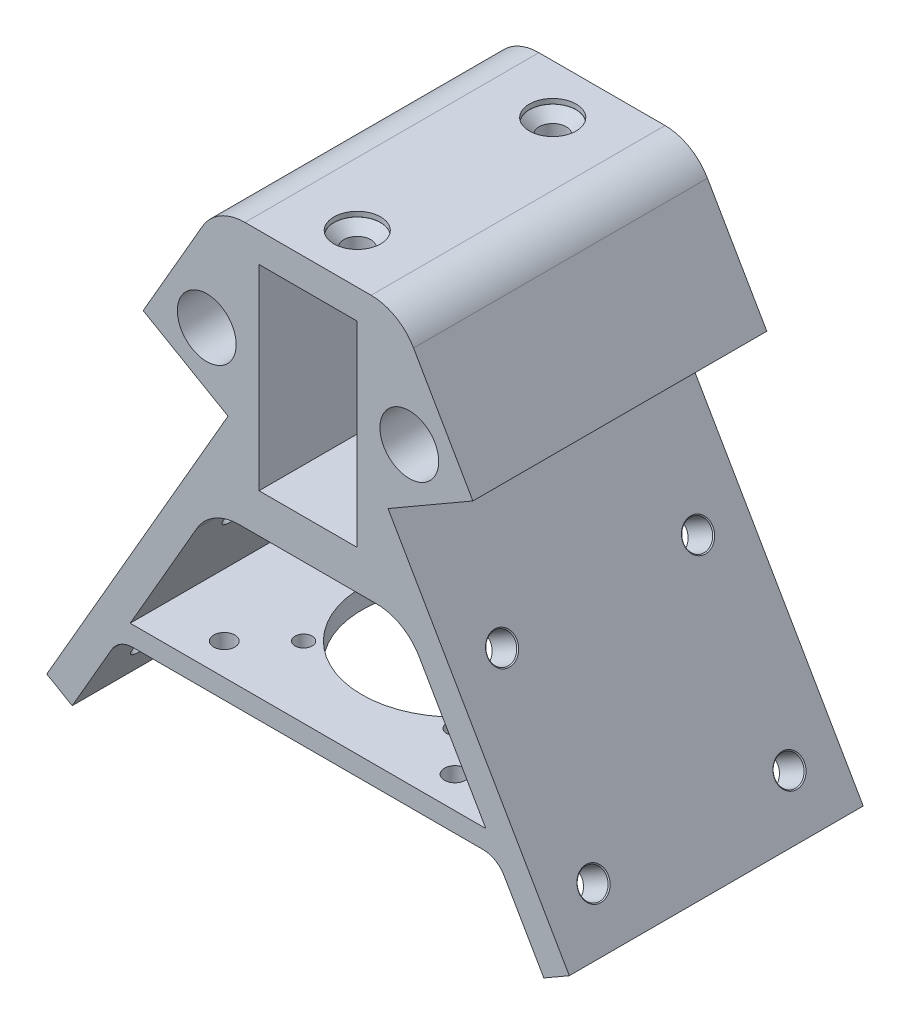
ISO-10303-21;
HEADER;
FILE_DESCRIPTION(('STEP AP214'),'2;1');
FILE_NAME('part.step','',(''),(''),'','','');
FILE_SCHEMA(('AUTOMOTIVE_DESIGN { 1 0 10303 214 1 1 1 1 }'));
ENDSEC;
DATA;
#1=APPLICATION_CONTEXT('core data for automotive mechanical design processes');
#2=APPLICATION_PROTOCOL_DEFINITION('international standard','automotive_design',2000,#1);
#3=PRODUCT_CONTEXT('',#1,'mechanical');
#4=PRODUCT('Part','Part','',(#3));
#5=PRODUCT_RELATED_PRODUCT_CATEGORY('part','',(#4));
#6=PRODUCT_DEFINITION_FORMATION('','',#4);
#7=PRODUCT_DEFINITION_CONTEXT('part definition',#1,'design');
#8=PRODUCT_DEFINITION('design','',#6,#7);
#9=PRODUCT_DEFINITION_SHAPE('','',#8);
#10=(LENGTH_UNIT() NAMED_UNIT(*) SI_UNIT(.MILLI.,.METRE.));
#11=(NAMED_UNIT(*) PLANE_ANGLE_UNIT() SI_UNIT($,.RADIAN.));
#12=(NAMED_UNIT(*) SI_UNIT($,.STERADIAN.) SOLID_ANGLE_UNIT());
#13=UNCERTAINTY_MEASURE_WITH_UNIT(LENGTH_MEASURE(1.E-05),#10,'distance_accuracy_value','');
#14=(GEOMETRIC_REPRESENTATION_CONTEXT(3) GLOBAL_UNCERTAINTY_ASSIGNED_CONTEXT((#13)) GLOBAL_UNIT_ASSIGNED_CONTEXT((#10,
#11,#12)) REPRESENTATION_CONTEXT('',''));
#15=CARTESIAN_POINT('',(0.,0.,0.));
#16=DIRECTION('',(0.,0.,1.));
#17=DIRECTION('',(1.,0.,0.));
#18=AXIS2_PLACEMENT_3D('',#15,#16,#17);
#19=CARTESIAN_POINT('',(23.5466558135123,100.067641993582,6.45334418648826));
#20=DIRECTION('',(0.,-1.,0.));
#21=DIRECTION('',(0.,0.,-1.));
#22=AXIS2_PLACEMENT_3D('',#19,#20,#21);
#23=CYLINDRICAL_SURFACE('',#22,2.15);
#24=CARTESIAN_POINT('',(23.5466558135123,17.5,6.45334418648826));
#25=DIRECTION('',(0.,1.,0.));
#26=DIRECTION('',(1.,0.,0.));
#27=AXIS2_PLACEMENT_3D('',#24,#25,#26);
#28=CIRCLE('',#27,2.15);
#29=CARTESIAN_POINT('',(25.6966558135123,17.5,6.45334418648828));
#30=VERTEX_POINT('',#29);
#31=EDGE_CURVE('E66',#30,#30,#28,.F.);
#32=ORIENTED_EDGE('',*,*,#31,.F.);
#33=EDGE_LOOP('',(#32));
#34=FACE_BOUND('',#33,.T.);
#35=CARTESIAN_POINT('',(23.5466558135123,13.5,6.45334418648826));
#36=DIRECTION('',(0.,-1.,0.));
#37=DIRECTION('',(0.,0.,-1.));
#38=AXIS2_PLACEMENT_3D('',#35,#36,#37);
#39=CIRCLE('',#38,2.15);
#40=CARTESIAN_POINT('',(23.5466558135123,13.5,4.30334418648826));
#41=VERTEX_POINT('',#40);
#42=EDGE_CURVE('E12',#41,#41,#39,.T.);
#43=ORIENTED_EDGE('',*,*,#42,.T.);
#44=EDGE_LOOP('',(#43));
#45=FACE_BOUND('',#44,.T.);
#46=ADVANCED_FACE('F57',(#34,#45),#23,.F.);
#47=CARTESIAN_POINT('',(15.4502831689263,100.067641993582,14.5497168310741));
#48=DIRECTION('',(0.,-1.,0.));
#49=DIRECTION('',(0.,0.,-1.));
#50=AXIS2_PLACEMENT_3D('',#47,#48,#49);
#51=CYLINDRICAL_SURFACE('',#50,1.75);
#52=CARTESIAN_POINT('',(15.4502831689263,17.5,14.5497168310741));
#53=DIRECTION('',(0.,1.,0.));
#54=DIRECTION('',(1.,0.,0.));
#55=AXIS2_PLACEMENT_3D('',#52,#53,#54);
#56=CIRCLE('',#55,1.75);
#57=CARTESIAN_POINT('',(17.2002831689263,17.5,14.5497168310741));
#58=VERTEX_POINT('',#57);
#59=EDGE_CURVE('E430',#58,#58,#56,.F.);
#60=ORIENTED_EDGE('',*,*,#59,.F.);
#61=EDGE_LOOP('',(#60));
#62=FACE_BOUND('',#61,.T.);
#63=CARTESIAN_POINT('',(15.4502831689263,13.5,14.5497168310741));
#64=DIRECTION('',(0.,-1.,0.));
#65=DIRECTION('',(0.,0.,-1.));
#66=AXIS2_PLACEMENT_3D('',#63,#64,#65);
#67=CIRCLE('',#66,1.75);
#68=CARTESIAN_POINT('',(15.4502831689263,13.5,12.7997168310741));
#69=VERTEX_POINT('',#68);
#70=EDGE_CURVE('E434',#69,#69,#67,.T.);
#71=ORIENTED_EDGE('',*,*,#70,.T.);
#72=EDGE_LOOP('',(#71));
#73=FACE_BOUND('',#72,.T.);
#74=ADVANCED_FACE('F447',(#62,#73),#51,.F.);
#75=CARTESIAN_POINT('',(-23.546655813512,100.067641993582,6.45334418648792));
#76=DIRECTION('',(0.,-1.,0.));
#77=DIRECTION('',(-1.,0.,0.));
#78=AXIS2_PLACEMENT_3D('',#75,#76,#77);
#79=CYLINDRICAL_SURFACE('',#78,2.15);
#80=CARTESIAN_POINT('',(-23.546655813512,17.5,6.45334418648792));
#81=DIRECTION('',(0.,1.,0.));
#82=DIRECTION('',(0.,0.,-1.));
#83=AXIS2_PLACEMENT_3D('',#80,#81,#82);
#84=CIRCLE('',#83,2.15);
#85=CARTESIAN_POINT('',(-23.546655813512,17.5,4.30334418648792));
#86=VERTEX_POINT('',#85);
#87=EDGE_CURVE('E423',#86,#86,#84,.F.);
#88=ORIENTED_EDGE('',*,*,#87,.F.);
#89=EDGE_LOOP('',(#88));
#90=FACE_BOUND('',#89,.T.);
#91=CARTESIAN_POINT('',(-23.546655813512,13.5,6.45334418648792));
#92=DIRECTION('',(0.,-1.,0.));
#93=DIRECTION('',(-1.,0.,0.));
#94=AXIS2_PLACEMENT_3D('',#91,#92,#93);
#95=CIRCLE('',#94,2.15);
#96=CARTESIAN_POINT('',(-25.696655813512,13.5,6.45334418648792));
#97=VERTEX_POINT('',#96);
#98=EDGE_CURVE('E426',#97,#97,#95,.T.);
#99=ORIENTED_EDGE('',*,*,#98,.T.);
#100=EDGE_LOOP('',(#99));
#101=FACE_BOUND('',#100,.T.);
#102=ADVANCED_FACE('F1136',(#90,#101),#79,.F.);
#103=CARTESIAN_POINT('',(-15.450283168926,100.067641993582,14.5497168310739));
#104=DIRECTION('',(0.,-1.,0.));
#105=DIRECTION('',(-1.,0.,0.));
#106=AXIS2_PLACEMENT_3D('',#103,#104,#105);
#107=CYLINDRICAL_SURFACE('',#106,1.75);
#108=CARTESIAN_POINT('',(-15.450283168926,17.5,14.5497168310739));
#109=DIRECTION('',(0.,1.,0.));
#110=DIRECTION('',(0.,0.,-1.));
#111=AXIS2_PLACEMENT_3D('',#108,#109,#110);
#112=CIRCLE('',#111,1.75);
#113=CARTESIAN_POINT('',(-15.450283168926,17.5,12.7997168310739));
#114=VERTEX_POINT('',#113);
#115=EDGE_CURVE('E415',#114,#114,#112,.F.);
#116=ORIENTED_EDGE('',*,*,#115,.F.);
#117=EDGE_LOOP('',(#116));
#118=FACE_BOUND('',#117,.T.);
#119=CARTESIAN_POINT('',(-15.450283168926,13.5,14.5497168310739));
#120=DIRECTION('',(0.,-1.,0.));
#121=DIRECTION('',(-1.,0.,0.));
#122=AXIS2_PLACEMENT_3D('',#119,#120,#121);
#123=CIRCLE('',#122,1.75);
#124=CARTESIAN_POINT('',(-17.200283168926,13.5,14.5497168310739));
#125=VERTEX_POINT('',#124);
#126=EDGE_CURVE('E419',#125,#125,#123,.T.);
#127=ORIENTED_EDGE('',*,*,#126,.T.);
#128=EDGE_LOOP('',(#127));
#129=FACE_BOUND('',#128,.T.);
#130=ADVANCED_FACE('F1132',(#118,#129),#107,.F.);
#131=CARTESIAN_POINT('',(-23.5466558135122,100.067641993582,53.5466558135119));
#132=DIRECTION('',(0.,-1.,0.));
#133=DIRECTION('',(0.,0.,1.));
#134=AXIS2_PLACEMENT_3D('',#131,#132,#133);
#135=CYLINDRICAL_SURFACE('',#134,2.15);
#136=CARTESIAN_POINT('',(-23.5466558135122,17.5,53.5466558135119));
#137=DIRECTION('',(0.,1.,0.));
#138=DIRECTION('',(-1.,0.,0.));
#139=AXIS2_PLACEMENT_3D('',#136,#137,#138);
#140=CIRCLE('',#139,2.15);
#141=CARTESIAN_POINT('',(-25.6966558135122,17.5,53.5466558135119));
#142=VERTEX_POINT('',#141);
#143=EDGE_CURVE('E407',#142,#142,#140,.F.);
#144=ORIENTED_EDGE('',*,*,#143,.F.);
#145=EDGE_LOOP('',(#144));
#146=FACE_BOUND('',#145,.T.);
#147=CARTESIAN_POINT('',(-23.5466558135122,13.5,53.5466558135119));
#148=DIRECTION('',(0.,-1.,0.));
#149=DIRECTION('',(0.,0.,1.));
#150=AXIS2_PLACEMENT_3D('',#147,#148,#149);
#151=CIRCLE('',#150,2.15);
#152=CARTESIAN_POINT('',(-23.5466558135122,13.5,55.6966558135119));
#153=VERTEX_POINT('',#152);
#154=EDGE_CURVE('E411',#153,#153,#151,.T.);
#155=ORIENTED_EDGE('',*,*,#154,.T.);
#156=EDGE_LOOP('',(#155));
#157=FACE_BOUND('',#156,.T.);
#158=ADVANCED_FACE('F1128',(#146,#157),#135,.F.);
#159=CARTESIAN_POINT('',(-15.4502831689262,100.067641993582,45.450283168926));
#160=DIRECTION('',(0.,-1.,0.));
#161=DIRECTION('',(0.,0.,1.));
#162=AXIS2_PLACEMENT_3D('',#159,#160,#161);
#163=CYLINDRICAL_SURFACE('',#162,1.75);
#164=CARTESIAN_POINT('',(-15.4502831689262,17.5,45.450283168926));
#165=DIRECTION('',(0.,1.,0.));
#166=DIRECTION('',(-1.,0.,0.));
#167=AXIS2_PLACEMENT_3D('',#164,#165,#166);
#168=CIRCLE('',#167,1.75);
#169=CARTESIAN_POINT('',(-17.2002831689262,17.5,45.450283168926));
#170=VERTEX_POINT('',#169);
#171=EDGE_CURVE('E399',#170,#170,#168,.F.);
#172=ORIENTED_EDGE('',*,*,#171,.F.);
#173=EDGE_LOOP('',(#172));
#174=FACE_BOUND('',#173,.T.);
#175=CARTESIAN_POINT('',(-15.4502831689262,13.5,45.450283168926));
#176=DIRECTION('',(0.,-1.,0.));
#177=DIRECTION('',(0.,0.,1.));
#178=AXIS2_PLACEMENT_3D('',#175,#176,#177);
#179=CIRCLE('',#178,1.75);
#180=CARTESIAN_POINT('',(-15.4502831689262,13.5,47.200283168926));
#181=VERTEX_POINT('',#180);
#182=EDGE_CURVE('E403',#181,#181,#179,.T.);
#183=ORIENTED_EDGE('',*,*,#182,.T.);
#184=EDGE_LOOP('',(#183));
#185=FACE_BOUND('',#184,.T.);
#186=ADVANCED_FACE('F1124',(#174,#185),#163,.F.);
#187=CARTESIAN_POINT('',(0.,-3.00100000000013,10.05));
#188=DIRECTION('',(0.,1.,0.));
#189=DIRECTION('',(-1.,0.,0.));
#190=AXIS2_PLACEMENT_3D('',#187,#188,#189);
#191=CYLINDRICAL_SURFACE('',#190,2.75);
#192=CARTESIAN_POINT('',(1.58152745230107E-13,97.0666419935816,10.05));
#193=DIRECTION('',(0.,1.,0.));
#194=DIRECTION('',(-1.,0.,0.));
#195=AXIS2_PLACEMENT_3D('',#192,#193,#194);
#196=CIRCLE('',#195,2.75);
#197=CARTESIAN_POINT('',(-2.74999999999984,97.0666419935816,10.05));
#198=VERTEX_POINT('',#197);
#199=EDGE_CURVE('E355',#198,#198,#196,.T.);
#200=ORIENTED_EDGE('',*,*,#199,.T.);
#201=EDGE_LOOP('',(#200));
#202=FACE_BOUND('',#201,.T.);
#203=CARTESIAN_POINT('',(1.53302820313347E-13,94.0666419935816,10.05));
#204=DIRECTION('',(0.,1.,0.));
#205=DIRECTION('',(0.,0.,1.));
#206=AXIS2_PLACEMENT_3D('',#203,#204,#205);
#207=CIRCLE('',#206,2.75);
#208=CARTESIAN_POINT('',(1.53302820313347E-13,94.0666419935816,12.8));
#209=VERTEX_POINT('',#208);
#210=EDGE_CURVE('E643',#209,#209,#207,.F.);
#211=ORIENTED_EDGE('',*,*,#210,.T.);
#212=EDGE_LOOP('',(#211));
#213=FACE_BOUND('',#212,.T.);
#214=ADVANCED_FACE('F1127',(#202,#213),#191,.F.);
#215=CARTESIAN_POINT('',(0.,-3.00100000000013,49.95));
#216=DIRECTION('',(0.,1.,0.));
#217=DIRECTION('',(-1.,0.,0.));
#218=AXIS2_PLACEMENT_3D('',#215,#216,#217);
#219=CYLINDRICAL_SURFACE('',#218,2.75);
#220=CARTESIAN_POINT('',(1.57258753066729E-13,97.0666419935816,49.95));
#221=DIRECTION('',(0.,1.,0.));
#222=DIRECTION('',(-1.,0.,0.));
#223=AXIS2_PLACEMENT_3D('',#220,#221,#222);
#224=CIRCLE('',#223,2.75);
#225=CARTESIAN_POINT('',(-2.74999999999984,97.0666419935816,49.95));
#226=VERTEX_POINT('',#225);
#227=EDGE_CURVE('E363',#226,#226,#224,.T.);
#228=ORIENTED_EDGE('',*,*,#227,.T.);
#229=EDGE_LOOP('',(#228));
#230=FACE_BOUND('',#229,.T.);
#231=CARTESIAN_POINT('',(1.52408828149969E-13,94.0666419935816,49.95));
#232=DIRECTION('',(0.,1.,0.));
#233=DIRECTION('',(0.,0.,1.));
#234=AXIS2_PLACEMENT_3D('',#231,#232,#233);
#235=CIRCLE('',#234,2.75);
#236=CARTESIAN_POINT('',(1.52408828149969E-13,94.0666419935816,52.7));
#237=VERTEX_POINT('',#236);
#238=EDGE_CURVE('E647',#237,#237,#235,.F.);
#239=ORIENTED_EDGE('',*,*,#238,.T.);
#240=EDGE_LOOP('',(#239));
#241=FACE_BOUND('',#240,.T.);
#242=ADVANCED_FACE('F1162',(#230,#241),#219,.F.);
#243=CARTESIAN_POINT('',(14.031197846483,36.0666419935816,60.));
#244=DIRECTION('',(0.,0.,-1.));
#245=DIRECTION('',(-1.,0.,0.));
#246=AXIS2_PLACEMENT_3D('',#243,#244,#245);
#247=CYLINDRICAL_SURFACE('',#246,10.);
#248=CARTESIAN_POINT('',(14.031197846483,36.0666419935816,0.));
#249=DIRECTION('',(0.,0.,1.));
#250=DIRECTION('',(1.,0.,0.));
#251=AXIS2_PLACEMENT_3D('',#248,#249,#250);
#252=CIRCLE('',#251,10.);
#253=CARTESIAN_POINT('',(22.6914518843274,41.0666419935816,0.));
#254=VERTEX_POINT('',#253);
#255=CARTESIAN_POINT('',(14.0311978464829,46.0666419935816,0.));
#256=VERTEX_POINT('',#255);
#257=EDGE_CURVE('E563',#254,#256,#252,.T.);
#258=ORIENTED_EDGE('',*,*,#257,.F.);
#259=DIRECTION('',(0.,0.,-1.));
#260=VECTOR('',#259,1.);
#261=CARTESIAN_POINT('',(22.6914518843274,41.0666419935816,60.));
#262=LINE('',#261,#260);
#263=CARTESIAN_POINT('',(22.6914518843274,41.0666419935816,60.));
#264=VERTEX_POINT('',#263);
#265=EDGE_CURVE('E280',#264,#254,#262,.T.);
#266=ORIENTED_EDGE('',*,*,#265,.F.);
#267=CARTESIAN_POINT('',(14.031197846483,36.0666419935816,60.));
#268=DIRECTION('',(0.,0.,1.));
#269=DIRECTION('',(1.,0.,0.));
#270=AXIS2_PLACEMENT_3D('',#267,#268,#269);
#271=CIRCLE('',#270,10.);
#272=CARTESIAN_POINT('',(14.0311978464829,46.0666419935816,60.));
#273=VERTEX_POINT('',#272);
#274=EDGE_CURVE('E731',#264,#273,#271,.T.);
#275=ORIENTED_EDGE('',*,*,#274,.T.);
#276=DIRECTION('',(0.,0.,-1.));
#277=VECTOR('',#276,1.);
#278=CARTESIAN_POINT('',(14.0311978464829,46.0666419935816,60.));
#279=LINE('',#278,#277);
#280=EDGE_CURVE('E163',#273,#256,#279,.T.);
#281=ORIENTED_EDGE('',*,*,#280,.T.);
#282=EDGE_LOOP('',(#258,#266,#275,#281));
#283=FACE_BOUND('',#282,.T.);
#284=ADVANCED_FACE('F1155',(#283),#247,.F.);
#285=CARTESIAN_POINT('',(34.8009665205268,20.0923473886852,60.));
#286=DIRECTION('',(-0.86602540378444,-0.499999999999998,0.));
#287=DIRECTION('',(0.499999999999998,-0.86602540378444,0.));
#288=AXIS2_PLACEMENT_3D('',#285,#286,#287);
#289=PLANE('',#288);
#290=CARTESIAN_POINT('',(24.4208395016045,38.071254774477,10.));
#291=DIRECTION('',(-0.866025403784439,-0.499999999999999,0.));
#292=DIRECTION('',(0.499999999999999,-0.866025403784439,0.));
#293=AXIS2_PLACEMENT_3D('',#290,#291,#292);
#294=CIRCLE('',#293,2.825);
#295=CARTESIAN_POINT('',(25.8333395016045,35.6247330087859,10.));
#296=VERTEX_POINT('',#295);
#297=EDGE_CURVE('E687',#296,#296,#294,.F.);
#298=ORIENTED_EDGE('',*,*,#297,.T.);
#299=EDGE_LOOP('',(#298));
#300=FACE_BOUND('',#299,.T.);
#301=CARTESIAN_POINT('',(24.4208395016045,38.071254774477,50.));
#302=DIRECTION('',(-0.866025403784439,-0.499999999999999,0.));
#303=DIRECTION('',(0.499999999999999,-0.866025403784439,0.));
#304=AXIS2_PLACEMENT_3D('',#301,#302,#303);
#305=CIRCLE('',#304,2.82500000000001);
#306=CARTESIAN_POINT('',(25.8333395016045,35.6247330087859,50.));
#307=VERTEX_POINT('',#306);
#308=EDGE_CURVE('E752',#307,#307,#305,.F.);
#309=ORIENTED_EDGE('',*,*,#308,.T.);
#310=EDGE_LOOP('',(#309));
#311=FACE_BOUND('',#310,.T.);
#312=DIRECTION('',(-0.499999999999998,0.86602540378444,0.));
#313=VECTOR('',#312,1.);
#314=CARTESIAN_POINT('',(34.8009665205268,20.0923473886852,0.));
#315=LINE('',#314,#313);
#316=CARTESIAN_POINT('',(36.2976589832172,17.5,0.));
#317=VERTEX_POINT('',#316);
#318=EDGE_CURVE('E566',#317,#254,#315,.T.);
#319=ORIENTED_EDGE('',*,*,#318,.F.);
#320=DIRECTION('',(0.,0.,-1.));
#321=VECTOR('',#320,1.);
#322=CARTESIAN_POINT('',(36.2976589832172,17.5,60.));
#323=LINE('',#322,#321);
#324=CARTESIAN_POINT('',(36.2976589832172,17.5,60.));
#325=VERTEX_POINT('',#324);
#326=EDGE_CURVE('E272',#325,#317,#323,.T.);
#327=ORIENTED_EDGE('',*,*,#326,.F.);
#328=DIRECTION('',(-0.499999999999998,0.86602540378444,0.));
#329=VECTOR('',#328,1.);
#330=CARTESIAN_POINT('',(34.8009665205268,20.0923473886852,60.));
#331=LINE('',#330,#329);
#332=EDGE_CURVE('E639',#325,#264,#331,.T.);
#333=ORIENTED_EDGE('',*,*,#332,.T.);
#334=ORIENTED_EDGE('',*,*,#265,.T.);
#335=EDGE_LOOP('',(#319,#327,#333,#334));
#336=FACE_BOUND('',#335,.T.);
#337=ADVANCED_FACE('F1148',(#300,#311,#336),#289,.T.);
#338=CARTESIAN_POINT('',(0.,17.5,60.));
#339=DIRECTION('',(0.,1.,0.));
#340=DIRECTION('',(0.,0.,1.));
#341=AXIS2_PLACEMENT_3D('',#338,#339,#340);
#342=PLANE('',#341);
#343=ORIENTED_EDGE('',*,*,#59,.T.);
#344=EDGE_LOOP('',(#343));
#345=FACE_BOUND('',#344,.T.);
#346=ORIENTED_EDGE('',*,*,#31,.T.);
#347=EDGE_LOOP('',(#346));
#348=FACE_BOUND('',#347,.T.);
#349=ORIENTED_EDGE('',*,*,#115,.T.);
#350=EDGE_LOOP('',(#349));
#351=FACE_BOUND('',#350,.T.);
#352=ORIENTED_EDGE('',*,*,#87,.T.);
#353=EDGE_LOOP('',(#352));
#354=FACE_BOUND('',#353,.T.);
#355=ORIENTED_EDGE('',*,*,#171,.T.);
#356=EDGE_LOOP('',(#355));
#357=FACE_BOUND('',#356,.T.);
#358=ORIENTED_EDGE('',*,*,#143,.T.);
#359=EDGE_LOOP('',(#358));
#360=FACE_BOUND('',#359,.T.);
#361=CARTESIAN_POINT('',(23.546655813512,17.5,53.5466558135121));
#362=DIRECTION('',(0.,1.,0.));
#363=DIRECTION('',(0.,0.,1.));
#364=AXIS2_PLACEMENT_3D('',#361,#362,#363);
#365=CIRCLE('',#364,2.15);
#366=CARTESIAN_POINT('',(23.546655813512,17.5,55.6966558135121));
#367=VERTEX_POINT('',#366);
#368=EDGE_CURVE('E718',#367,#367,#365,.F.);
#369=ORIENTED_EDGE('',*,*,#368,.T.);
#370=EDGE_LOOP('',(#369));
#371=FACE_BOUND('',#370,.T.);
#372=CARTESIAN_POINT('',(15.450283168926,17.5,45.4502831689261));
#373=DIRECTION('',(0.,1.,0.));
#374=DIRECTION('',(0.,0.,1.));
#375=AXIS2_PLACEMENT_3D('',#372,#373,#374);
#376=CIRCLE('',#375,1.75);
#377=CARTESIAN_POINT('',(15.450283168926,17.5,47.2002831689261));
#378=VERTEX_POINT('',#377);
#379=EDGE_CURVE('E595',#378,#378,#376,.F.);
#380=ORIENTED_EDGE('',*,*,#379,.T.);
#381=EDGE_LOOP('',(#380));
#382=FACE_BOUND('',#381,.T.);
#383=CARTESIAN_POINT('',(0.,17.5,30.));
#384=DIRECTION('',(0.,1.,0.));
#385=DIRECTION('',(0.,0.,1.));
#386=AXIS2_PLACEMENT_3D('',#383,#384,#385);
#387=CIRCLE('',#386,19.);
#388=CARTESIAN_POINT('',(0.,17.5,49.));
#389=VERTEX_POINT('',#388);
#390=EDGE_CURVE('E704',#389,#389,#387,.F.);
#391=ORIENTED_EDGE('',*,*,#390,.T.);
#392=EDGE_LOOP('',(#391));
#393=FACE_BOUND('',#392,.T.);
#394=DIRECTION('',(1.,0.,0.));
#395=VECTOR('',#394,1.);
#396=CARTESIAN_POINT('',(0.,17.5,0.));
#397=LINE('',#396,#395);
#398=CARTESIAN_POINT('',(-36.2976589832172,17.5,0.));
#399=VERTEX_POINT('',#398);
#400=EDGE_CURVE('E570',#399,#317,#397,.T.);
#401=ORIENTED_EDGE('',*,*,#400,.F.);
#402=DIRECTION('',(0.,0.,-1.));
#403=VECTOR('',#402,1.);
#404=CARTESIAN_POINT('',(-36.2976589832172,17.5,60.));
#405=LINE('',#404,#403);
#406=CARTESIAN_POINT('',(-36.2976589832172,17.5,60.));
#407=VERTEX_POINT('',#406);
#408=EDGE_CURVE('E266',#407,#399,#405,.T.);
#409=ORIENTED_EDGE('',*,*,#408,.F.);
#410=DIRECTION('',(1.,0.,0.));
#411=VECTOR('',#410,1.);
#412=CARTESIAN_POINT('',(0.,17.5,60.));
#413=LINE('',#412,#411);
#414=EDGE_CURVE('E258',#407,#325,#413,.T.);
#415=ORIENTED_EDGE('',*,*,#414,.T.);
#416=ORIENTED_EDGE('',*,*,#326,.T.);
#417=EDGE_LOOP('',(#401,#409,#415,#416));
#418=FACE_BOUND('',#417,.T.);
#419=ADVANCED_FACE('F442',(#345,#348,#351,#354,#357,#360,#371,#382,#393,#418),#342,.T.);
#420=CARTESIAN_POINT('',(-34.8009665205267,20.0923473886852,60.));
#421=DIRECTION('',(-0.866025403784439,0.499999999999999,0.));
#422=DIRECTION('',(-0.499999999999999,-0.866025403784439,0.));
#423=AXIS2_PLACEMENT_3D('',#420,#421,#422);
#424=PLANE('',#423);
#425=CARTESIAN_POINT('',(-24.4208395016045,38.071254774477,50.));
#426=DIRECTION('',(-0.866025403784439,0.499999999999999,0.));
#427=DIRECTION('',(-0.499999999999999,-0.866025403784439,0.));
#428=AXIS2_PLACEMENT_3D('',#425,#426,#427);
#429=CIRCLE('',#428,2.82500000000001);
#430=CARTESIAN_POINT('',(-25.8333395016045,35.6247330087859,50.));
#431=VERTEX_POINT('',#430);
#432=EDGE_CURVE('E609',#431,#431,#429,.F.);
#433=ORIENTED_EDGE('',*,*,#432,.F.);
#434=EDGE_LOOP('',(#433));
#435=FACE_BOUND('',#434,.T.);
#436=CARTESIAN_POINT('',(-24.4208395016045,38.071254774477,10.));
#437=DIRECTION('',(-0.866025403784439,0.499999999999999,0.));
#438=DIRECTION('',(-0.499999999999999,-0.866025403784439,0.));
#439=AXIS2_PLACEMENT_3D('',#436,#437,#438);
#440=CIRCLE('',#439,2.825);
#441=CARTESIAN_POINT('',(-25.8333395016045,35.6247330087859,10.));
#442=VERTEX_POINT('',#441);
#443=EDGE_CURVE('E814',#442,#442,#440,.F.);
#444=ORIENTED_EDGE('',*,*,#443,.F.);
#445=EDGE_LOOP('',(#444));
#446=FACE_BOUND('',#445,.T.);
#447=DIRECTION('',(0.499999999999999,0.866025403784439,0.));
#448=VECTOR('',#447,1.);
#449=CARTESIAN_POINT('',(-34.8009665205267,20.0923473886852,0.));
#450=LINE('',#449,#448);
#451=CARTESIAN_POINT('',(-22.6914518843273,41.0666419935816,0.));
#452=VERTEX_POINT('',#451);
#453=EDGE_CURVE('E264',#399,#452,#450,.T.);
#454=ORIENTED_EDGE('',*,*,#453,.T.);
#455=DIRECTION('',(0.,0.,-1.));
#456=VECTOR('',#455,1.);
#457=CARTESIAN_POINT('',(-22.6914518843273,41.0666419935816,60.));
#458=LINE('',#457,#456);
#459=CARTESIAN_POINT('',(-22.6914518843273,41.0666419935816,60.));
#460=VERTEX_POINT('',#459);
#461=EDGE_CURVE('E246',#460,#452,#458,.T.);
#462=ORIENTED_EDGE('',*,*,#461,.F.);
#463=DIRECTION('',(0.499999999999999,0.866025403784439,0.));
#464=VECTOR('',#463,1.);
#465=CARTESIAN_POINT('',(-34.8009665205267,20.0923473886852,60.));
#466=LINE('',#465,#464);
#467=EDGE_CURVE('E250',#407,#460,#466,.T.);
#468=ORIENTED_EDGE('',*,*,#467,.F.);
#469=ORIENTED_EDGE('',*,*,#408,.T.);
#470=EDGE_LOOP('',(#454,#462,#468,#469));
#471=FACE_BOUND('',#470,.T.);
#472=ADVANCED_FACE('F262',(#435,#446,#471),#424,.F.);
#473=CARTESIAN_POINT('',(-14.031197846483,36.0666419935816,60.));
#474=DIRECTION('',(0.,0.,-1.));
#475=DIRECTION('',(-1.,0.,0.));
#476=AXIS2_PLACEMENT_3D('',#473,#474,#475);
#477=CYLINDRICAL_SURFACE('',#476,9.99999999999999);
#478=CARTESIAN_POINT('',(-14.031197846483,36.0666419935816,0.));
#479=DIRECTION('',(0.,0.,1.));
#480=DIRECTION('',(1.,0.,0.));
#481=AXIS2_PLACEMENT_3D('',#478,#479,#480);
#482=CIRCLE('',#481,9.99999999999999);
#483=CARTESIAN_POINT('',(-14.0311978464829,46.0666419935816,0.));
#484=VERTEX_POINT('',#483);
#485=EDGE_CURVE('E576',#452,#484,#482,.F.);
#486=ORIENTED_EDGE('',*,*,#485,.T.);
#487=DIRECTION('',(0.,0.,-1.));
#488=VECTOR('',#487,1.);
#489=CARTESIAN_POINT('',(-14.0311978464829,46.0666419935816,60.));
#490=LINE('',#489,#488);
#491=CARTESIAN_POINT('',(-14.0311978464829,46.0666419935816,60.));
#492=VERTEX_POINT('',#491);
#493=EDGE_CURVE('E248',#492,#484,#490,.T.);
#494=ORIENTED_EDGE('',*,*,#493,.F.);
#495=CARTESIAN_POINT('',(-14.031197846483,36.0666419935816,60.));
#496=DIRECTION('',(0.,0.,1.));
#497=DIRECTION('',(1.,0.,0.));
#498=AXIS2_PLACEMENT_3D('',#495,#496,#497);
#499=CIRCLE('',#498,9.99999999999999);
#500=EDGE_CURVE('E241',#460,#492,#499,.F.);
#501=ORIENTED_EDGE('',*,*,#500,.F.);
#502=ORIENTED_EDGE('',*,*,#461,.T.);
#503=EDGE_LOOP('',(#486,#494,#501,#502));
#504=FACE_BOUND('',#503,.T.);
#505=ADVANCED_FACE('F244',(#504),#477,.F.);
#506=CARTESIAN_POINT('',(0.,94.0666419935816,60.));
#507=DIRECTION('',(0.,1.,0.));
#508=DIRECTION('',(0.,0.,1.));
#509=AXIS2_PLACEMENT_3D('',#506,#507,#508);
#510=PLANE('',#509);
#511=ORIENTED_EDGE('',*,*,#238,.F.);
#512=EDGE_LOOP('',(#511));
#513=FACE_BOUND('',#512,.T.);
#514=ORIENTED_EDGE('',*,*,#210,.F.);
#515=EDGE_LOOP('',(#514));
#516=FACE_BOUND('',#515,.T.);
#517=DIRECTION('',(1.,0.,0.));
#518=VECTOR('',#517,1.);
#519=CARTESIAN_POINT('',(0.,94.0666419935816,0.));
#520=LINE('',#519,#518);
#521=CARTESIAN_POINT('',(-10.,94.0666419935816,0.));
#522=VERTEX_POINT('',#521);
#523=CARTESIAN_POINT('',(9.99999999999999,94.0666419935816,0.));
#524=VERTEX_POINT('',#523);
#525=EDGE_CURVE('E547',#522,#524,#520,.T.);
#526=ORIENTED_EDGE('',*,*,#525,.T.);
#527=DIRECTION('',(0.,0.,-1.));
#528=VECTOR('',#527,1.);
#529=CARTESIAN_POINT('',(9.99999999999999,94.0666419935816,60.));
#530=LINE('',#529,#528);
#531=CARTESIAN_POINT('',(9.99999999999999,94.0666419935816,60.));
#532=VERTEX_POINT('',#531);
#533=EDGE_CURVE('E293',#532,#524,#530,.T.);
#534=ORIENTED_EDGE('',*,*,#533,.F.);
#535=DIRECTION('',(1.,0.,0.));
#536=VECTOR('',#535,1.);
#537=CARTESIAN_POINT('',(0.,94.0666419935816,60.));
#538=LINE('',#537,#536);
#539=CARTESIAN_POINT('',(-10.,94.0666419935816,60.));
#540=VERTEX_POINT('',#539);
#541=EDGE_CURVE('E802',#540,#532,#538,.T.);
#542=ORIENTED_EDGE('',*,*,#541,.F.);
#543=DIRECTION('',(0.,0.,-1.));
#544=VECTOR('',#543,1.);
#545=CARTESIAN_POINT('',(-10.,94.0666419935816,60.));
#546=LINE('',#545,#544);
#547=EDGE_CURVE('E284',#540,#522,#546,.T.);
#548=ORIENTED_EDGE('',*,*,#547,.T.);
#549=EDGE_LOOP('',(#526,#534,#542,#548));
#550=FACE_BOUND('',#549,.T.);
#551=ADVANCED_FACE('F1170',(#513,#516,#550),#510,.F.);
#552=CARTESIAN_POINT('',(10.,0.,60.));
#553=DIRECTION('',(1.,0.,0.));
#554=DIRECTION('',(0.,1.,0.));
#555=AXIS2_PLACEMENT_3D('',#552,#553,#554);
#556=PLANE('',#555);
#557=DIRECTION('',(0.,-1.,0.));
#558=VECTOR('',#557,1.);
#559=CARTESIAN_POINT('',(10.,0.,0.));
#560=LINE('',#559,#558);
#561=CARTESIAN_POINT('',(9.99999999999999,54.0666419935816,0.));
#562=VERTEX_POINT('',#561);
#563=EDGE_CURVE('E551',#524,#562,#560,.T.);
#564=ORIENTED_EDGE('',*,*,#563,.T.);
#565=DIRECTION('',(0.,0.,-1.));
#566=VECTOR('',#565,1.);
#567=CARTESIAN_POINT('',(9.99999999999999,54.0666419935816,60.));
#568=LINE('',#567,#566);
#569=CARTESIAN_POINT('',(9.99999999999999,54.0666419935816,60.));
#570=VERTEX_POINT('',#569);
#571=EDGE_CURVE('E290',#570,#562,#568,.T.);
#572=ORIENTED_EDGE('',*,*,#571,.F.);
#573=DIRECTION('',(0.,-1.,0.));
#574=VECTOR('',#573,1.);
#575=CARTESIAN_POINT('',(10.,0.,60.));
#576=LINE('',#575,#574);
#577=EDGE_CURVE('E806',#532,#570,#576,.T.);
#578=ORIENTED_EDGE('',*,*,#577,.F.);
#579=ORIENTED_EDGE('',*,*,#533,.T.);
#580=EDGE_LOOP('',(#564,#572,#578,#579));
#581=FACE_BOUND('',#580,.T.);
#582=ADVANCED_FACE('F1091',(#581),#556,.F.);
#583=CARTESIAN_POINT('',(0.,54.0666419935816,60.));
#584=DIRECTION('',(0.,1.,0.));
#585=DIRECTION('',(0.,0.,1.));
#586=AXIS2_PLACEMENT_3D('',#583,#584,#585);
#587=PLANE('',#586);
#588=DIRECTION('',(1.,0.,0.));
#589=VECTOR('',#588,1.);
#590=CARTESIAN_POINT('',(0.,54.0666419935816,0.));
#591=LINE('',#590,#589);
#592=CARTESIAN_POINT('',(-10.,54.0666419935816,0.));
#593=VERTEX_POINT('',#592);
#594=EDGE_CURVE('E555',#593,#562,#591,.T.);
#595=ORIENTED_EDGE('',*,*,#594,.F.);
#596=DIRECTION('',(0.,0.,-1.));
#597=VECTOR('',#596,1.);
#598=CARTESIAN_POINT('',(-10.,54.0666419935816,60.));
#599=LINE('',#598,#597);
#600=CARTESIAN_POINT('',(-10.,54.0666419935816,60.));
#601=VERTEX_POINT('',#600);
#602=EDGE_CURVE('E287',#601,#593,#599,.T.);
#603=ORIENTED_EDGE('',*,*,#602,.F.);
#604=DIRECTION('',(1.,0.,0.));
#605=VECTOR('',#604,1.);
#606=CARTESIAN_POINT('',(0.,54.0666419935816,60.));
#607=LINE('',#606,#605);
#608=EDGE_CURVE('E868',#601,#570,#607,.T.);
#609=ORIENTED_EDGE('',*,*,#608,.T.);
#610=ORIENTED_EDGE('',*,*,#571,.T.);
#611=EDGE_LOOP('',(#595,#603,#609,#610));
#612=FACE_BOUND('',#611,.T.);
#613=ADVANCED_FACE('F1087',(#612),#587,.T.);
#614=CARTESIAN_POINT('',(-35.7203087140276,8.49999999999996,60.));
#615=DIRECTION('',(0.,0.,-1.));
#616=DIRECTION('',(-1.,0.,0.));
#617=AXIS2_PLACEMENT_3D('',#614,#615,#616);
#618=CYLINDRICAL_SURFACE('',#617,5.);
#619=CARTESIAN_POINT('',(-35.7203087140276,8.49999999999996,0.));
#620=DIRECTION('',(0.,0.,1.));
#621=DIRECTION('',(1.,0.,0.));
#622=AXIS2_PLACEMENT_3D('',#619,#620,#621);
#623=CIRCLE('',#622,5.);
#624=CARTESIAN_POINT('',(-35.7203087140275,13.5,0.));
#625=VERTEX_POINT('',#624);
#626=CARTESIAN_POINT('',(-40.0504357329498,10.9999999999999,0.));
#627=VERTEX_POINT('',#626);
#628=EDGE_CURVE('E486',#625,#627,#623,.T.);
#629=ORIENTED_EDGE('',*,*,#628,.F.);
#630=DIRECTION('',(0.,0.,-1.));
#631=VECTOR('',#630,1.);
#632=CARTESIAN_POINT('',(-35.7203087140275,13.5,60.));
#633=LINE('',#632,#631);
#634=CARTESIAN_POINT('',(-35.7203087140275,13.5,60.));
#635=VERTEX_POINT('',#634);
#636=EDGE_CURVE('E170',#635,#625,#633,.T.);
#637=ORIENTED_EDGE('',*,*,#636,.F.);
#638=CARTESIAN_POINT('',(-35.7203087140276,8.49999999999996,60.));
#639=DIRECTION('',(0.,0.,1.));
#640=DIRECTION('',(1.,0.,0.));
#641=AXIS2_PLACEMENT_3D('',#638,#639,#640);
#642=CIRCLE('',#641,5.);
#643=CARTESIAN_POINT('',(-40.0504357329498,10.9999999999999,60.));
#644=VERTEX_POINT('',#643);
#645=EDGE_CURVE('E588',#635,#644,#642,.T.);
#646=ORIENTED_EDGE('',*,*,#645,.T.);
#647=DIRECTION('',(0.,0.,-1.));
#648=VECTOR('',#647,1.);
#649=CARTESIAN_POINT('',(-40.0504357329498,10.9999999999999,60.));
#650=LINE('',#649,#648);
#651=EDGE_CURVE('E297',#644,#627,#650,.T.);
#652=ORIENTED_EDGE('',*,*,#651,.T.);
#653=EDGE_LOOP('',(#629,#637,#646,#652));
#654=FACE_BOUND('',#653,.T.);
#655=ADVANCED_FACE('F454',(#654),#618,.F.);
#656=CARTESIAN_POINT('',(0.,13.5,60.));
#657=DIRECTION('',(0.,1.,0.));
#658=DIRECTION('',(-1.,0.,0.));
#659=AXIS2_PLACEMENT_3D('',#656,#657,#658);
#660=PLANE('',#659);
#661=ORIENTED_EDGE('',*,*,#70,.F.);
#662=EDGE_LOOP('',(#661));
#663=FACE_BOUND('',#662,.T.);
#664=ORIENTED_EDGE('',*,*,#42,.F.);
#665=EDGE_LOOP('',(#664));
#666=FACE_BOUND('',#665,.T.);
#667=ORIENTED_EDGE('',*,*,#126,.F.);
#668=EDGE_LOOP('',(#667));
#669=FACE_BOUND('',#668,.T.);
#670=ORIENTED_EDGE('',*,*,#98,.F.);
#671=EDGE_LOOP('',(#670));
#672=FACE_BOUND('',#671,.T.);
#673=ORIENTED_EDGE('',*,*,#182,.F.);
#674=EDGE_LOOP('',(#673));
#675=FACE_BOUND('',#674,.T.);
#676=ORIENTED_EDGE('',*,*,#154,.F.);
#677=EDGE_LOOP('',(#676));
#678=FACE_BOUND('',#677,.T.);
#679=CARTESIAN_POINT('',(23.546655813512,13.5,53.5466558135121));
#680=DIRECTION('',(0.,-1.,0.));
#681=DIRECTION('',(1.,0.,0.));
#682=AXIS2_PLACEMENT_3D('',#679,#680,#681);
#683=CIRCLE('',#682,2.15);
#684=CARTESIAN_POINT('',(25.696655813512,13.5,53.5466558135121));
#685=VERTEX_POINT('',#684);
#686=EDGE_CURVE('E468',#685,#685,#683,.T.);
#687=ORIENTED_EDGE('',*,*,#686,.F.);
#688=EDGE_LOOP('',(#687));
#689=FACE_BOUND('',#688,.T.);
#690=CARTESIAN_POINT('',(15.450283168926,13.5,45.4502831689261));
#691=DIRECTION('',(0.,-1.,0.));
#692=DIRECTION('',(1.,0.,0.));
#693=AXIS2_PLACEMENT_3D('',#690,#691,#692);
#694=CIRCLE('',#693,1.75);
#695=CARTESIAN_POINT('',(17.200283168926,13.5,45.4502831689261));
#696=VERTEX_POINT('',#695);
#697=EDGE_CURVE('E472',#696,#696,#694,.T.);
#698=ORIENTED_EDGE('',*,*,#697,.F.);
#699=EDGE_LOOP('',(#698));
#700=FACE_BOUND('',#699,.T.);
#701=CARTESIAN_POINT('',(0.,13.5,30.));
#702=DIRECTION('',(0.,-1.,0.));
#703=DIRECTION('',(1.,0.,0.));
#704=AXIS2_PLACEMENT_3D('',#701,#702,#703);
#705=CIRCLE('',#704,19.);
#706=CARTESIAN_POINT('',(19.,13.5,30.));
#707=VERTEX_POINT('',#706);
#708=EDGE_CURVE('E476',#707,#707,#705,.T.);
#709=ORIENTED_EDGE('',*,*,#708,.F.);
#710=EDGE_LOOP('',(#709));
#711=FACE_BOUND('',#710,.T.);
#712=DIRECTION('',(1.,0.,0.));
#713=VECTOR('',#712,1.);
#714=CARTESIAN_POINT('',(0.,13.5,0.));
#715=LINE('',#714,#713);
#716=CARTESIAN_POINT('',(35.7203087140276,13.5,0.));
#717=VERTEX_POINT('',#716);
#718=EDGE_CURVE('E479',#625,#717,#715,.T.);
#719=ORIENTED_EDGE('',*,*,#718,.T.);
#720=DIRECTION('',(0.,0.,-1.));
#721=VECTOR('',#720,1.);
#722=CARTESIAN_POINT('',(35.7203087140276,13.5,60.));
#723=LINE('',#722,#721);
#724=CARTESIAN_POINT('',(35.7203087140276,13.5,60.));
#725=VERTEX_POINT('',#724);
#726=EDGE_CURVE('E346',#725,#717,#723,.T.);
#727=ORIENTED_EDGE('',*,*,#726,.F.);
#728=DIRECTION('',(1.,0.,0.));
#729=VECTOR('',#728,1.);
#730=CARTESIAN_POINT('',(0.,13.5,60.));
#731=LINE('',#730,#729);
#732=EDGE_CURVE('E834',#635,#725,#731,.T.);
#733=ORIENTED_EDGE('',*,*,#732,.F.);
#734=ORIENTED_EDGE('',*,*,#636,.T.);
#735=EDGE_LOOP('',(#719,#727,#733,#734));
#736=FACE_BOUND('',#735,.T.);
#737=ADVANCED_FACE('F450',(#663,#666,#669,#672,#675,#678,#689,#700,#711,#736),#660,.F.);
#738=CARTESIAN_POINT('',(35.7203087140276,8.49999999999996,60.));
#739=DIRECTION('',(0.,0.,-1.));
#740=DIRECTION('',(-1.,0.,0.));
#741=AXIS2_PLACEMENT_3D('',#738,#739,#740);
#742=CYLINDRICAL_SURFACE('',#741,5.);
#743=CARTESIAN_POINT('',(35.7203087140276,8.49999999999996,0.));
#744=DIRECTION('',(0.,0.,1.));
#745=DIRECTION('',(1.,0.,0.));
#746=AXIS2_PLACEMENT_3D('',#743,#744,#745);
#747=CIRCLE('',#746,5.);
#748=CARTESIAN_POINT('',(40.0504357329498,10.9999999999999,0.));
#749=VERTEX_POINT('',#748);
#750=EDGE_CURVE('E485',#717,#749,#747,.F.);
#751=ORIENTED_EDGE('',*,*,#750,.T.);
#752=DIRECTION('',(0.,0.,-1.));
#753=VECTOR('',#752,1.);
#754=CARTESIAN_POINT('',(40.0504357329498,10.9999999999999,60.));
#755=LINE('',#754,#753);
#756=CARTESIAN_POINT('',(40.0504357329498,10.9999999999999,60.));
#757=VERTEX_POINT('',#756);
#758=EDGE_CURVE('E343',#757,#749,#755,.T.);
#759=ORIENTED_EDGE('',*,*,#758,.F.);
#760=CARTESIAN_POINT('',(35.7203087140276,8.49999999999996,60.));
#761=DIRECTION('',(0.,0.,1.));
#762=DIRECTION('',(1.,0.,0.));
#763=AXIS2_PLACEMENT_3D('',#760,#761,#762);
#764=CIRCLE('',#763,5.);
#765=EDGE_CURVE('E492',#725,#757,#764,.F.);
#766=ORIENTED_EDGE('',*,*,#765,.F.);
#767=ORIENTED_EDGE('',*,*,#726,.T.);
#768=EDGE_LOOP('',(#751,#759,#766,#767));
#769=FACE_BOUND('',#768,.T.);
#770=ADVANCED_FACE('F453',(#769),#742,.F.);
#771=CARTESIAN_POINT('',(34.8009665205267,20.0923473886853,60.));
#772=DIRECTION('',(-0.866025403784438,-0.500000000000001,0.));
#773=DIRECTION('',(0.500000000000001,-0.866025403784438,0.));
#774=AXIS2_PLACEMENT_3D('',#771,#772,#773);
#775=PLANE('',#774);
#776=CARTESIAN_POINT('',(43.0708395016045,5.76850721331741,10.));
#777=DIRECTION('',(-0.866025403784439,-0.499999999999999,0.));
#778=DIRECTION('',(0.499999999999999,-0.866025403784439,0.));
#779=AXIS2_PLACEMENT_3D('',#776,#777,#778);
#780=CIRCLE('',#779,2.825);
#781=CARTESIAN_POINT('',(44.4833395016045,3.32198544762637,10.));
#782=VERTEX_POINT('',#781);
#783=EDGE_CURVE('E674',#782,#782,#780,.F.);
#784=ORIENTED_EDGE('',*,*,#783,.T.);
#785=EDGE_LOOP('',(#784));
#786=FACE_BOUND('',#785,.T.);
#787=CARTESIAN_POINT('',(43.0708395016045,5.76850721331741,50.));
#788=DIRECTION('',(-0.866025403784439,-0.499999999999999,0.));
#789=DIRECTION('',(0.499999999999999,-0.866025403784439,0.));
#790=AXIS2_PLACEMENT_3D('',#787,#788,#789);
#791=CIRCLE('',#790,2.825);
#792=CARTESIAN_POINT('',(44.4833395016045,3.32198544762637,50.));
#793=VERTEX_POINT('',#792);
#794=EDGE_CURVE('E860',#793,#793,#791,.F.);
#795=ORIENTED_EDGE('',*,*,#794,.T.);
#796=EDGE_LOOP('',(#795));
#797=FACE_BOUND('',#796,.T.);
#798=DIRECTION('',(-0.500000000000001,0.866025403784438,0.));
#799=VECTOR('',#798,1.);
#800=CARTESIAN_POINT('',(34.8009665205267,20.0923473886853,0.));
#801=LINE('',#800,#799);
#802=CARTESIAN_POINT('',(48.1333395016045,-3.00000000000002,0.));
#803=VERTEX_POINT('',#802);
#804=EDGE_CURVE('E497',#803,#749,#801,.T.);
#805=ORIENTED_EDGE('',*,*,#804,.F.);
#806=DIRECTION('',(0.,0.,-1.));
#807=VECTOR('',#806,1.);
#808=CARTESIAN_POINT('',(48.1333395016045,-3.00000000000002,60.));
#809=LINE('',#808,#807);
#810=CARTESIAN_POINT('',(48.1333395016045,-3.00000000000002,60.));
#811=VERTEX_POINT('',#810);
#812=EDGE_CURVE('E340',#811,#803,#809,.T.);
#813=ORIENTED_EDGE('',*,*,#812,.F.);
#814=DIRECTION('',(-0.500000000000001,0.866025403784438,0.));
#815=VECTOR('',#814,1.);
#816=CARTESIAN_POINT('',(34.8009665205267,20.0923473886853,60.));
#817=LINE('',#816,#815);
#818=EDGE_CURVE('E828',#811,#757,#817,.T.);
#819=ORIENTED_EDGE('',*,*,#818,.T.);
#820=ORIENTED_EDGE('',*,*,#758,.T.);
#821=EDGE_LOOP('',(#805,#813,#819,#820));
#822=FACE_BOUND('',#821,.T.);
#823=ADVANCED_FACE('F1207',(#786,#797,#822),#775,.T.);
#824=CARTESIAN_POINT('',(13.3323729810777,-23.0923473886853,60.));
#825=DIRECTION('',(0.499999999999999,-0.866025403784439,0.));
#826=DIRECTION('',(0.866025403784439,0.499999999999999,0.));
#827=AXIS2_PLACEMENT_3D('',#824,#825,#826);
#828=PLANE('',#827);
#829=DIRECTION('',(-0.866025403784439,-0.499999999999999,0.));
#830=VECTOR('',#829,1.);
#831=CARTESIAN_POINT('',(13.3323729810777,-23.0923473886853,0.));
#832=LINE('',#831,#830);
#833=CARTESIAN_POINT('',(53.3294919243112,0.,0.));
#834=VERTEX_POINT('',#833);
#835=EDGE_CURVE('E503',#834,#803,#832,.T.);
#836=ORIENTED_EDGE('',*,*,#835,.F.);
#837=DIRECTION('',(0.,0.,-1.));
#838=VECTOR('',#837,1.);
#839=CARTESIAN_POINT('',(53.3294919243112,0.,60.));
#840=LINE('',#839,#838);
#841=CARTESIAN_POINT('',(53.3294919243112,0.,60.));
#842=VERTEX_POINT('',#841);
#843=EDGE_CURVE('E337',#842,#834,#840,.T.);
#844=ORIENTED_EDGE('',*,*,#843,.F.);
#845=DIRECTION('',(-0.866025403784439,-0.499999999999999,0.));
#846=VECTOR('',#845,1.);
#847=CARTESIAN_POINT('',(13.3323729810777,-23.0923473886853,60.));
#848=LINE('',#847,#846);
#849=EDGE_CURVE('E824',#842,#811,#848,.T.);
#850=ORIENTED_EDGE('',*,*,#849,.T.);
#851=ORIENTED_EDGE('',*,*,#812,.T.);
#852=EDGE_LOOP('',(#836,#844,#850,#851));
#853=FACE_BOUND('',#852,.T.);
#854=ADVANCED_FACE('F1203',(#853),#828,.T.);
#855=CARTESIAN_POINT('',(39.9971189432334,23.0923473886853,60.));
#856=DIRECTION('',(0.866025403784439,0.5,0.));
#857=DIRECTION('',(-0.5,0.866025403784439,0.));
#858=AXIS2_PLACEMENT_3D('',#855,#856,#857);
#859=PLANE('',#858);
#860=CARTESIAN_POINT('',(29.6169919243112,41.071254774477,10.));
#861=DIRECTION('',(0.866025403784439,0.499999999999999,0.));
#862=DIRECTION('',(-0.499999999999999,0.866025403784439,0.));
#863=AXIS2_PLACEMENT_3D('',#860,#861,#862);
#864=CIRCLE('',#863,3.02500000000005);
#865=CARTESIAN_POINT('',(28.1044919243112,43.690981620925,10.));
#866=VERTEX_POINT('',#865);
#867=EDGE_CURVE('E693',#866,#866,#864,.T.);
#868=ORIENTED_EDGE('',*,*,#867,.F.);
#869=EDGE_LOOP('',(#868));
#870=FACE_BOUND('',#869,.T.);
#871=CARTESIAN_POINT('',(48.2669919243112,8.76850721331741,10.));
#872=DIRECTION('',(0.866025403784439,0.499999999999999,0.));
#873=DIRECTION('',(-0.499999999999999,0.866025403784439,0.));
#874=AXIS2_PLACEMENT_3D('',#871,#872,#873);
#875=CIRCLE('',#874,3.02500000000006);
#876=CARTESIAN_POINT('',(46.7544919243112,11.3882340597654,10.));
#877=VERTEX_POINT('',#876);
#878=EDGE_CURVE('E671',#877,#877,#875,.T.);
#879=ORIENTED_EDGE('',*,*,#878,.F.);
#880=EDGE_LOOP('',(#879));
#881=FACE_BOUND('',#880,.T.);
#882=CARTESIAN_POINT('',(48.2669919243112,8.76850721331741,50.));
#883=DIRECTION('',(0.866025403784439,0.499999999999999,0.));
#884=DIRECTION('',(-0.499999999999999,0.866025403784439,0.));
#885=AXIS2_PLACEMENT_3D('',#882,#883,#884);
#886=CIRCLE('',#885,3.02499999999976);
#887=CARTESIAN_POINT('',(46.7544919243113,11.3882340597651,50.));
#888=VERTEX_POINT('',#887);
#889=EDGE_CURVE('E747',#888,#888,#886,.T.);
#890=ORIENTED_EDGE('',*,*,#889,.F.);
#891=EDGE_LOOP('',(#890));
#892=FACE_BOUND('',#891,.T.);
#893=CARTESIAN_POINT('',(29.6169919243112,41.071254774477,50.));
#894=DIRECTION('',(0.866025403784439,0.499999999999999,0.));
#895=DIRECTION('',(-0.499999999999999,0.866025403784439,0.));
#896=AXIS2_PLACEMENT_3D('',#893,#894,#895);
#897=CIRCLE('',#896,3.02499999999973);
#898=CARTESIAN_POINT('',(28.1044919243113,43.6909816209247,50.));
#899=VERTEX_POINT('',#898);
#900=EDGE_CURVE('E939',#899,#899,#897,.T.);
#901=ORIENTED_EDGE('',*,*,#900,.F.);
#902=EDGE_LOOP('',(#901));
#903=FACE_BOUND('',#902,.T.);
#904=DIRECTION('',(0.5,-0.866025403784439,0.));
#905=VECTOR('',#904,1.);
#906=CARTESIAN_POINT('',(39.9971189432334,23.0923473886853,0.));
#907=LINE('',#906,#905);
#908=CARTESIAN_POINT('',(16.3294919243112,64.0858798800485,0.));
#909=VERTEX_POINT('',#908);
#910=EDGE_CURVE('E509',#909,#834,#907,.T.);
#911=ORIENTED_EDGE('',*,*,#910,.F.);
#912=DIRECTION('',(0.,0.,-1.));
#913=VECTOR('',#912,1.);
#914=CARTESIAN_POINT('',(16.3294919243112,64.0858798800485,60.));
#915=LINE('',#914,#913);
#916=CARTESIAN_POINT('',(16.3294919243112,64.0858798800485,60.));
#917=VERTEX_POINT('',#916);
#918=EDGE_CURVE('E334',#917,#909,#915,.T.);
#919=ORIENTED_EDGE('',*,*,#918,.F.);
#920=DIRECTION('',(0.5,-0.866025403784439,0.));
#921=VECTOR('',#920,1.);
#922=CARTESIAN_POINT('',(39.9971189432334,23.0923473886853,60.));
#923=LINE('',#922,#921);
#924=EDGE_CURVE('E820',#917,#842,#923,.T.);
#925=ORIENTED_EDGE('',*,*,#924,.T.);
#926=ORIENTED_EDGE('',*,*,#843,.T.);
#927=EDGE_LOOP('',(#911,#919,#925,#926));
#928=FACE_BOUND('',#927,.T.);
#929=ADVANCED_FACE('F1036',(#870,#881,#892,#903,#928),#859,.T.);
#930=CARTESIAN_POINT('',(-23.6676270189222,40.9935324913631,60.));
#931=DIRECTION('',(0.5,-0.866025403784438,0.));
#932=DIRECTION('',(0.866025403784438,0.5,0.));
#933=AXIS2_PLACEMENT_3D('',#930,#931,#932);
#934=PLANE('',#933);
#935=DIRECTION('',(-0.866025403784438,-0.5,0.));
#936=VECTOR('',#935,1.);
#937=CARTESIAN_POINT('',(-23.6676270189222,40.9935324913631,0.));
#938=LINE('',#937,#936);
#939=CARTESIAN_POINT('',(33.65,74.0858798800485,0.));
#940=VERTEX_POINT('',#939);
#941=EDGE_CURVE('E513',#940,#909,#938,.T.);
#942=ORIENTED_EDGE('',*,*,#941,.F.);
#943=DIRECTION('',(0.,0.,-1.));
#944=VECTOR('',#943,1.);
#945=CARTESIAN_POINT('',(33.65,74.0858798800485,60.));
#946=LINE('',#945,#944);
#947=CARTESIAN_POINT('',(33.65,74.0858798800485,60.));
#948=VERTEX_POINT('',#947);
#949=EDGE_CURVE('E331',#948,#940,#946,.T.);
#950=ORIENTED_EDGE('',*,*,#949,.F.);
#951=DIRECTION('',(-0.866025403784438,-0.5,0.));
#952=VECTOR('',#951,1.);
#953=CARTESIAN_POINT('',(-23.6676270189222,40.9935324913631,60.));
#954=LINE('',#953,#952);
#955=EDGE_CURVE('E666',#948,#917,#954,.T.);
#956=ORIENTED_EDGE('',*,*,#955,.T.);
#957=ORIENTED_EDGE('',*,*,#918,.T.);
#958=EDGE_LOOP('',(#942,#950,#956,#957));
#959=FACE_BOUND('',#958,.T.);
#960=ADVANCED_FACE('F1047',(#959),#934,.T.);
#961=CARTESIAN_POINT('',(57.3176270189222,33.0923473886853,60.));
#962=DIRECTION('',(0.866025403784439,0.5,0.));
#963=DIRECTION('',(-0.5,0.866025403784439,0.));
#964=AXIS2_PLACEMENT_3D('',#961,#962,#963);
#965=PLANE('',#964);
#966=DIRECTION('',(0.5,-0.866025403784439,0.));
#967=VECTOR('',#966,1.);
#968=CARTESIAN_POINT('',(57.3176270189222,33.0923473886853,0.));
#969=LINE('',#968,#967);
#970=CARTESIAN_POINT('',(21.5367513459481,95.0666419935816,0.));
#971=VERTEX_POINT('',#970);
#972=EDGE_CURVE('E517',#971,#940,#969,.T.);
#973=ORIENTED_EDGE('',*,*,#972,.F.);
#974=DIRECTION('',(0.,0.,-1.));
#975=VECTOR('',#974,1.);
#976=CARTESIAN_POINT('',(21.5367513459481,95.0666419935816,60.));
#977=LINE('',#976,#975);
#978=CARTESIAN_POINT('',(21.5367513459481,95.0666419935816,60.));
#979=VERTEX_POINT('',#978);
#980=EDGE_CURVE('E328',#979,#971,#977,.T.);
#981=ORIENTED_EDGE('',*,*,#980,.F.);
#982=DIRECTION('',(0.5,-0.866025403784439,0.));
#983=VECTOR('',#982,1.);
#984=CARTESIAN_POINT('',(57.3176270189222,33.0923473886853,60.));
#985=LINE('',#984,#983);
#986=EDGE_CURVE('E662',#979,#948,#985,.T.);
#987=ORIENTED_EDGE('',*,*,#986,.T.);
#988=ORIENTED_EDGE('',*,*,#949,.T.);
#989=EDGE_LOOP('',(#973,#981,#987,#988));
#990=FACE_BOUND('',#989,.T.);
#991=ADVANCED_FACE('F1050',(#990),#965,.T.);
#992=CARTESIAN_POINT('',(12.8764973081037,90.0666419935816,60.));
#993=DIRECTION('',(0.,0.,-1.));
#994=DIRECTION('',(-1.,0.,0.));
#995=AXIS2_PLACEMENT_3D('',#992,#993,#994);
#996=CYLINDRICAL_SURFACE('',#995,9.99999999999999);
#997=CARTESIAN_POINT('',(12.8764973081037,90.0666419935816,0.));
#998=DIRECTION('',(0.,0.,1.));
#999=DIRECTION('',(1.,0.,0.));
#1000=AXIS2_PLACEMENT_3D('',#997,#998,#999);
#1001=CIRCLE('',#1000,9.99999999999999);
#1002=CARTESIAN_POINT('',(12.8764973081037,100.066641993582,0.));
#1003=VERTEX_POINT('',#1002);
#1004=EDGE_CURVE('E521',#1003,#971,#1001,.F.);
#1005=ORIENTED_EDGE('',*,*,#1004,.F.);
#1006=DIRECTION('',(0.,0.,-1.));
#1007=VECTOR('',#1006,1.);
#1008=CARTESIAN_POINT('',(12.8764973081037,100.066641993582,60.));
#1009=LINE('',#1008,#1007);
#1010=CARTESIAN_POINT('',(12.8764973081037,100.066641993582,60.));
#1011=VERTEX_POINT('',#1010);
#1012=EDGE_CURVE('E325',#1011,#1003,#1009,.T.);
#1013=ORIENTED_EDGE('',*,*,#1012,.F.);
#1014=CARTESIAN_POINT('',(12.8764973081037,90.0666419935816,60.));
#1015=DIRECTION('',(0.,0.,1.));
#1016=DIRECTION('',(1.,0.,0.));
#1017=AXIS2_PLACEMENT_3D('',#1014,#1015,#1016);
#1018=CIRCLE('',#1017,9.99999999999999);
#1019=EDGE_CURVE('E665',#1011,#979,#1018,.F.);
#1020=ORIENTED_EDGE('',*,*,#1019,.T.);
#1021=ORIENTED_EDGE('',*,*,#980,.T.);
#1022=EDGE_LOOP('',(#1005,#1013,#1020,#1021));
#1023=FACE_BOUND('',#1022,.T.);
#1024=ADVANCED_FACE('F1193',(#1023),#996,.T.);
#1025=CARTESIAN_POINT('',(1.61771900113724E-13,100.066641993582,60.));
#1026=DIRECTION('',(0.,-1.,0.));
#1027=DIRECTION('',(1.,0.,0.));
#1028=AXIS2_PLACEMENT_3D('',#1025,#1026,#1027);
#1029=PLANE('',#1028);
#1030=CARTESIAN_POINT('',(1.62108677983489E-13,100.066641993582,49.95));
#1031=DIRECTION('',(0.,1.,0.));
#1032=DIRECTION('',(-1.,0.,0.));
#1033=AXIS2_PLACEMENT_3D('',#1030,#1031,#1032);
#1034=CIRCLE('',#1033,4.775);
#1035=CARTESIAN_POINT('',(-4.77499999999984,100.066641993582,49.95));
#1036=VERTEX_POINT('',#1035);
#1037=EDGE_CURVE('E852',#1036,#1036,#1034,.T.);
#1038=ORIENTED_EDGE('',*,*,#1037,.F.);
#1039=EDGE_LOOP('',(#1038));
#1040=FACE_BOUND('',#1039,.T.);
#1041=CARTESIAN_POINT('',(1.63002670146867E-13,100.066641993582,10.05));
#1042=DIRECTION('',(0.,1.,0.));
#1043=DIRECTION('',(-1.,0.,0.));
#1044=AXIS2_PLACEMENT_3D('',#1041,#1042,#1043);
#1045=CIRCLE('',#1044,4.775);
#1046=CARTESIAN_POINT('',(-4.77499999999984,100.066641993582,10.05));
#1047=VERTEX_POINT('',#1046);
#1048=EDGE_CURVE('E624',#1047,#1047,#1045,.T.);
#1049=ORIENTED_EDGE('',*,*,#1048,.F.);
#1050=EDGE_LOOP('',(#1049));
#1051=FACE_BOUND('',#1050,.T.);
#1052=DIRECTION('',(-1.,0.,0.));
#1053=VECTOR('',#1052,1.);
#1054=CARTESIAN_POINT('',(1.61771900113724E-13,100.066641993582,0.));
#1055=LINE('',#1054,#1053);
#1056=CARTESIAN_POINT('',(-12.8764973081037,100.066641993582,0.));
#1057=VERTEX_POINT('',#1056);
#1058=EDGE_CURVE('E525',#1003,#1057,#1055,.T.);
#1059=ORIENTED_EDGE('',*,*,#1058,.T.);
#1060=DIRECTION('',(0.,0.,-1.));
#1061=VECTOR('',#1060,1.);
#1062=CARTESIAN_POINT('',(-12.8764973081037,100.066641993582,60.));
#1063=LINE('',#1062,#1061);
#1064=CARTESIAN_POINT('',(-12.8764973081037,100.066641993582,60.));
#1065=VERTEX_POINT('',#1064);
#1066=EDGE_CURVE('E321',#1065,#1057,#1063,.T.);
#1067=ORIENTED_EDGE('',*,*,#1066,.F.);
#1068=DIRECTION('',(-1.,0.,0.));
#1069=VECTOR('',#1068,1.);
#1070=CARTESIAN_POINT('',(1.61771900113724E-13,100.066641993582,60.));
#1071=LINE('',#1070,#1069);
#1072=EDGE_CURVE('E928',#1011,#1065,#1071,.T.);
#1073=ORIENTED_EDGE('',*,*,#1072,.F.);
#1074=ORIENTED_EDGE('',*,*,#1012,.T.);
#1075=EDGE_LOOP('',(#1059,#1067,#1073,#1074));
#1076=FACE_BOUND('',#1075,.T.);
#1077=ADVANCED_FACE('F1056',(#1040,#1051,#1076),#1029,.F.);
#1078=CARTESIAN_POINT('',(-12.8764973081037,90.0666419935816,60.));
#1079=DIRECTION('',(0.,0.,-1.));
#1080=DIRECTION('',(-1.,0.,0.));
#1081=AXIS2_PLACEMENT_3D('',#1078,#1079,#1080);
#1082=CYLINDRICAL_SURFACE('',#1081,10.);
#1083=CARTESIAN_POINT('',(-12.8764973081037,90.0666419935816,0.));
#1084=DIRECTION('',(0.,0.,1.));
#1085=DIRECTION('',(1.,0.,0.));
#1086=AXIS2_PLACEMENT_3D('',#1083,#1084,#1085);
#1087=CIRCLE('',#1086,10.);
#1088=CARTESIAN_POINT('',(-21.5367513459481,95.0666419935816,0.));
#1089=VERTEX_POINT('',#1088);
#1090=EDGE_CURVE('E528',#1057,#1089,#1087,.T.);
#1091=ORIENTED_EDGE('',*,*,#1090,.T.);
#1092=DIRECTION('',(0.,0.,-1.));
#1093=VECTOR('',#1092,1.);
#1094=CARTESIAN_POINT('',(-21.5367513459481,95.0666419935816,60.));
#1095=LINE('',#1094,#1093);
#1096=CARTESIAN_POINT('',(-21.5367513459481,95.0666419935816,60.));
#1097=VERTEX_POINT('',#1096);
#1098=EDGE_CURVE('E317',#1097,#1089,#1095,.T.);
#1099=ORIENTED_EDGE('',*,*,#1098,.F.);
#1100=CARTESIAN_POINT('',(-12.8764973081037,90.0666419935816,60.));
#1101=DIRECTION('',(0.,0.,1.));
#1102=DIRECTION('',(1.,0.,0.));
#1103=AXIS2_PLACEMENT_3D('',#1100,#1101,#1102);
#1104=CIRCLE('',#1103,10.);
#1105=EDGE_CURVE('E657',#1065,#1097,#1104,.T.);
#1106=ORIENTED_EDGE('',*,*,#1105,.F.);
#1107=ORIENTED_EDGE('',*,*,#1066,.T.);
#1108=EDGE_LOOP('',(#1091,#1099,#1106,#1107));
#1109=FACE_BOUND('',#1108,.T.);
#1110=ADVANCED_FACE('F1060',(#1109),#1082,.T.);
#1111=CARTESIAN_POINT('',(-57.3176270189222,33.0923473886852,60.));
#1112=DIRECTION('',(0.866025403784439,-0.499999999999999,0.));
#1113=DIRECTION('',(0.499999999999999,0.866025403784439,0.));
#1114=AXIS2_PLACEMENT_3D('',#1111,#1112,#1113);
#1115=PLANE('',#1114);
#1116=DIRECTION('',(-0.499999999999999,-0.866025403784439,0.));
#1117=VECTOR('',#1116,1.);
#1118=CARTESIAN_POINT('',(-57.3176270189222,33.0923473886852,0.));
#1119=LINE('',#1118,#1117);
#1120=CARTESIAN_POINT('',(-33.65,74.0858798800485,0.));
#1121=VERTEX_POINT('',#1120);
#1122=EDGE_CURVE('E531',#1089,#1121,#1119,.T.);
#1123=ORIENTED_EDGE('',*,*,#1122,.T.);
#1124=DIRECTION('',(0.,0.,-1.));
#1125=VECTOR('',#1124,1.);
#1126=CARTESIAN_POINT('',(-33.65,74.0858798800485,60.));
#1127=LINE('',#1126,#1125);
#1128=CARTESIAN_POINT('',(-33.65,74.0858798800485,60.));
#1129=VERTEX_POINT('',#1128);
#1130=EDGE_CURVE('E313',#1129,#1121,#1127,.T.);
#1131=ORIENTED_EDGE('',*,*,#1130,.F.);
#1132=DIRECTION('',(-0.499999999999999,-0.866025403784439,0.));
#1133=VECTOR('',#1132,1.);
#1134=CARTESIAN_POINT('',(-57.3176270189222,33.0923473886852,60.));
#1135=LINE('',#1134,#1133);
#1136=EDGE_CURVE('E653',#1097,#1129,#1135,.T.);
#1137=ORIENTED_EDGE('',*,*,#1136,.F.);
#1138=ORIENTED_EDGE('',*,*,#1098,.T.);
#1139=EDGE_LOOP('',(#1123,#1131,#1137,#1138));
#1140=FACE_BOUND('',#1139,.T.);
#1141=ADVANCED_FACE('F1065',(#1140),#1115,.F.);
#1142=CARTESIAN_POINT('',(23.6676270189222,40.9935324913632,60.));
#1143=DIRECTION('',(0.5,0.866025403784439,0.));
#1144=DIRECTION('',(-0.866025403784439,0.5,0.));
#1145=AXIS2_PLACEMENT_3D('',#1142,#1143,#1144);
#1146=PLANE('',#1145);
#1147=DIRECTION('',(0.866025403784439,-0.5,0.));
#1148=VECTOR('',#1147,1.);
#1149=CARTESIAN_POINT('',(23.6676270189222,40.9935324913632,0.));
#1150=LINE('',#1149,#1148);
#1151=CARTESIAN_POINT('',(-16.3294919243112,64.0858798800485,0.));
#1152=VERTEX_POINT('',#1151);
#1153=EDGE_CURVE('E534',#1121,#1152,#1150,.T.);
#1154=ORIENTED_EDGE('',*,*,#1153,.T.);
#1155=DIRECTION('',(0.,0.,-1.));
#1156=VECTOR('',#1155,1.);
#1157=CARTESIAN_POINT('',(-16.3294919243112,64.0858798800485,60.));
#1158=LINE('',#1157,#1156);
#1159=CARTESIAN_POINT('',(-16.3294919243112,64.0858798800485,60.));
#1160=VERTEX_POINT('',#1159);
#1161=EDGE_CURVE('E309',#1160,#1152,#1158,.T.);
#1162=ORIENTED_EDGE('',*,*,#1161,.F.);
#1163=DIRECTION('',(0.866025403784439,-0.5,0.));
#1164=VECTOR('',#1163,1.);
#1165=CARTESIAN_POINT('',(23.6676270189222,40.9935324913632,60.));
#1166=LINE('',#1165,#1164);
#1167=EDGE_CURVE('E656',#1129,#1160,#1166,.T.);
#1168=ORIENTED_EDGE('',*,*,#1167,.F.);
#1169=ORIENTED_EDGE('',*,*,#1130,.T.);
#1170=EDGE_LOOP('',(#1154,#1162,#1168,#1169));
#1171=FACE_BOUND('',#1170,.T.);
#1172=ADVANCED_FACE('F1071',(#1171),#1146,.F.);
#1173=CARTESIAN_POINT('',(-39.9971189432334,23.0923473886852,60.));
#1174=DIRECTION('',(0.866025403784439,-0.499999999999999,0.));
#1175=DIRECTION('',(0.499999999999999,0.866025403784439,0.));
#1176=AXIS2_PLACEMENT_3D('',#1173,#1174,#1175);
#1177=PLANE('',#1176);
#1178=CARTESIAN_POINT('',(-48.2669919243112,8.76850721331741,50.));
#1179=DIRECTION('',(0.866025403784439,-0.499999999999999,0.));
#1180=DIRECTION('',(0.499999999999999,0.866025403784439,0.));
#1181=AXIS2_PLACEMENT_3D('',#1178,#1179,#1180);
#1182=CIRCLE('',#1181,3.02499999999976);
#1183=CARTESIAN_POINT('',(-46.7544919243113,11.3882340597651,50.));
#1184=VERTEX_POINT('',#1183);
#1185=EDGE_CURVE('E383',#1184,#1184,#1182,.T.);
#1186=ORIENTED_EDGE('',*,*,#1185,.T.);
#1187=EDGE_LOOP('',(#1186));
#1188=FACE_BOUND('',#1187,.T.);
#1189=CARTESIAN_POINT('',(-48.2669919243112,8.76850721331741,10.));
#1190=DIRECTION('',(0.866025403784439,-0.499999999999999,0.));
#1191=DIRECTION('',(0.499999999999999,0.866025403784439,0.));
#1192=AXIS2_PLACEMENT_3D('',#1189,#1190,#1191);
#1193=CIRCLE('',#1192,3.02500000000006);
#1194=CARTESIAN_POINT('',(-46.7544919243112,11.3882340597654,10.));
#1195=VERTEX_POINT('',#1194);
#1196=EDGE_CURVE('E379',#1195,#1195,#1193,.T.);
#1197=ORIENTED_EDGE('',*,*,#1196,.T.);
#1198=EDGE_LOOP('',(#1197));
#1199=FACE_BOUND('',#1198,.T.);
#1200=CARTESIAN_POINT('',(-29.6169919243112,41.071254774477,10.));
#1201=DIRECTION('',(0.866025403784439,-0.499999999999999,0.));
#1202=DIRECTION('',(0.499999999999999,0.866025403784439,0.));
#1203=AXIS2_PLACEMENT_3D('',#1200,#1201,#1202);
#1204=CIRCLE('',#1203,3.02500000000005);
#1205=CARTESIAN_POINT('',(-28.1044919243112,43.690981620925,10.));
#1206=VERTEX_POINT('',#1205);
#1207=EDGE_CURVE('E375',#1206,#1206,#1204,.T.);
#1208=ORIENTED_EDGE('',*,*,#1207,.T.);
#1209=EDGE_LOOP('',(#1208));
#1210=FACE_BOUND('',#1209,.T.);
#1211=CARTESIAN_POINT('',(-29.6169919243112,41.071254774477,50.));
#1212=DIRECTION('',(0.866025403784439,-0.499999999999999,0.));
#1213=DIRECTION('',(0.499999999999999,0.866025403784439,0.));
#1214=AXIS2_PLACEMENT_3D('',#1211,#1212,#1213);
#1215=CIRCLE('',#1214,3.02499999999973);
#1216=CARTESIAN_POINT('',(-28.1044919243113,43.6909816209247,50.));
#1217=VERTEX_POINT('',#1216);
#1218=EDGE_CURVE('E371',#1217,#1217,#1215,.T.);
#1219=ORIENTED_EDGE('',*,*,#1218,.T.);
#1220=EDGE_LOOP('',(#1219));
#1221=FACE_BOUND('',#1220,.T.);
#1222=DIRECTION('',(-0.5,-0.866025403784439,0.));
#1223=VECTOR('',#1222,1.);
#1224=CARTESIAN_POINT('',(-39.9971189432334,23.0923473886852,0.));
#1225=LINE('',#1224,#1223);
#1226=CARTESIAN_POINT('',(-53.3294919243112,0.,0.));
#1227=VERTEX_POINT('',#1226);
#1228=EDGE_CURVE('E537',#1152,#1227,#1225,.T.);
#1229=ORIENTED_EDGE('',*,*,#1228,.T.);
#1230=DIRECTION('',(0.,0.,-1.));
#1231=VECTOR('',#1230,1.);
#1232=CARTESIAN_POINT('',(-53.3294919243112,0.,60.));
#1233=LINE('',#1232,#1231);
#1234=CARTESIAN_POINT('',(-53.3294919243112,0.,60.));
#1235=VERTEX_POINT('',#1234);
#1236=EDGE_CURVE('E305',#1235,#1227,#1233,.T.);
#1237=ORIENTED_EDGE('',*,*,#1236,.F.);
#1238=DIRECTION('',(-0.5,-0.866025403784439,0.));
#1239=VECTOR('',#1238,1.);
#1240=CARTESIAN_POINT('',(-39.9971189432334,23.0923473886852,60.));
#1241=LINE('',#1240,#1239);
#1242=EDGE_CURVE('E759',#1160,#1235,#1241,.T.);
#1243=ORIENTED_EDGE('',*,*,#1242,.F.);
#1244=ORIENTED_EDGE('',*,*,#1161,.T.);
#1245=EDGE_LOOP('',(#1229,#1237,#1243,#1244));
#1246=FACE_BOUND('',#1245,.T.);
#1247=ADVANCED_FACE('F1075',(#1188,#1199,#1210,#1221,#1246),#1177,.F.);
#1248=CARTESIAN_POINT('',(-13.3323729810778,-23.0923473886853,60.));
#1249=DIRECTION('',(0.499999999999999,0.866025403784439,0.));
#1250=DIRECTION('',(-0.866025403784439,0.499999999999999,0.));
#1251=AXIS2_PLACEMENT_3D('',#1248,#1249,#1250);
#1252=PLANE('',#1251);
#1253=DIRECTION('',(0.866025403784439,-0.499999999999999,0.));
#1254=VECTOR('',#1253,1.);
#1255=CARTESIAN_POINT('',(-13.3323729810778,-23.0923473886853,0.));
#1256=LINE('',#1255,#1254);
#1257=CARTESIAN_POINT('',(-48.1333395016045,-3.00000000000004,0.));
#1258=VERTEX_POINT('',#1257);
#1259=EDGE_CURVE('E540',#1227,#1258,#1256,.T.);
#1260=ORIENTED_EDGE('',*,*,#1259,.T.);
#1261=DIRECTION('',(0.,0.,-1.));
#1262=VECTOR('',#1261,1.);
#1263=CARTESIAN_POINT('',(-48.1333395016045,-3.00000000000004,60.));
#1264=LINE('',#1263,#1262);
#1265=CARTESIAN_POINT('',(-48.1333395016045,-3.00000000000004,60.));
#1266=VERTEX_POINT('',#1265);
#1267=EDGE_CURVE('E300',#1266,#1258,#1264,.T.);
#1268=ORIENTED_EDGE('',*,*,#1267,.F.);
#1269=DIRECTION('',(0.866025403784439,-0.499999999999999,0.));
#1270=VECTOR('',#1269,1.);
#1271=CARTESIAN_POINT('',(-13.3323729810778,-23.0923473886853,60.));
#1272=LINE('',#1271,#1270);
#1273=EDGE_CURVE('E761',#1235,#1266,#1272,.T.);
#1274=ORIENTED_EDGE('',*,*,#1273,.F.);
#1275=ORIENTED_EDGE('',*,*,#1236,.T.);
#1276=EDGE_LOOP('',(#1260,#1268,#1274,#1275));
#1277=FACE_BOUND('',#1276,.T.);
#1278=ADVANCED_FACE('F1080',(#1277),#1252,.F.);
#1279=CARTESIAN_POINT('',(-20.6727586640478,77.5631212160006,60.));
#1280=DIRECTION('',(0.,0.,-1.));
#1281=DIRECTION('',(-1.,0.,0.));
#1282=AXIS2_PLACEMENT_3D('',#1279,#1280,#1281);
#1283=CYLINDRICAL_SURFACE('',#1282,6.00000000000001);
#1284=CARTESIAN_POINT('',(-20.6727586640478,77.5631212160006,60.));
#1285=DIRECTION('',(0.,0.,1.));
#1286=DIRECTION('',(1.,0.,0.));
#1287=AXIS2_PLACEMENT_3D('',#1284,#1285,#1286);
#1288=CIRCLE('',#1287,6.00000000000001);
#1289=CARTESIAN_POINT('',(-14.6727586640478,77.5631212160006,60.));
#1290=VERTEX_POINT('',#1289);
#1291=EDGE_CURVE('E778',#1290,#1290,#1288,.T.);
#1292=ORIENTED_EDGE('',*,*,#1291,.T.);
#1293=EDGE_LOOP('',(#1292));
#1294=FACE_BOUND('',#1293,.T.);
#1295=CARTESIAN_POINT('',(-20.6727586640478,77.5631212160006,0.));
#1296=DIRECTION('',(0.,0.,1.));
#1297=DIRECTION('',(1.,0.,0.));
#1298=AXIS2_PLACEMENT_3D('',#1295,#1296,#1297);
#1299=CIRCLE('',#1298,6.00000000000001);
#1300=CARTESIAN_POINT('',(-14.6727586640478,77.5631212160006,0.));
#1301=VERTEX_POINT('',#1300);
#1302=EDGE_CURVE('E581',#1301,#1301,#1299,.T.);
#1303=ORIENTED_EDGE('',*,*,#1302,.F.);
#1304=EDGE_LOOP('',(#1303));
#1305=FACE_BOUND('',#1304,.T.);
#1306=ADVANCED_FACE('F1181',(#1294,#1305),#1283,.F.);
#1307=CARTESIAN_POINT('',(0.,46.0666419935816,60.));
#1308=DIRECTION('',(0.,1.,0.));
#1309=DIRECTION('',(-1.,0.,0.));
#1310=AXIS2_PLACEMENT_3D('',#1307,#1308,#1309);
#1311=PLANE('',#1310);
#1312=DIRECTION('',(1.,0.,0.));
#1313=VECTOR('',#1312,1.);
#1314=CARTESIAN_POINT('',(0.,46.0666419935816,0.));
#1315=LINE('',#1314,#1313);
#1316=EDGE_CURVE('E156',#484,#256,#1315,.T.);
#1317=ORIENTED_EDGE('',*,*,#1316,.T.);
#1318=ORIENTED_EDGE('',*,*,#280,.F.);
#1319=DIRECTION('',(1.,0.,0.));
#1320=VECTOR('',#1319,1.);
#1321=CARTESIAN_POINT('',(0.,46.0666419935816,60.));
#1322=LINE('',#1321,#1320);
#1323=EDGE_CURVE('E74',#492,#273,#1322,.T.);
#1324=ORIENTED_EDGE('',*,*,#1323,.F.);
#1325=ORIENTED_EDGE('',*,*,#493,.T.);
#1326=EDGE_LOOP('',(#1317,#1318,#1324,#1325));
#1327=FACE_BOUND('',#1326,.T.);
#1328=ADVANCED_FACE('F1165',(#1327),#1311,.F.);
#1329=CARTESIAN_POINT('',(-10.,0.,60.));
#1330=DIRECTION('',(1.,0.,0.));
#1331=DIRECTION('',(0.,1.,0.));
#1332=AXIS2_PLACEMENT_3D('',#1329,#1330,#1331);
#1333=PLANE('',#1332);
#1334=DIRECTION('',(0.,-1.,0.));
#1335=VECTOR('',#1334,1.);
#1336=CARTESIAN_POINT('',(-10.,0.,0.));
#1337=LINE('',#1336,#1335);
#1338=EDGE_CURVE('E559',#522,#593,#1337,.T.);
#1339=ORIENTED_EDGE('',*,*,#1338,.F.);
#1340=ORIENTED_EDGE('',*,*,#547,.F.);
#1341=DIRECTION('',(0.,-1.,0.));
#1342=VECTOR('',#1341,1.);
#1343=CARTESIAN_POINT('',(-10.,0.,60.));
#1344=LINE('',#1343,#1342);
#1345=EDGE_CURVE('E872',#540,#601,#1344,.T.);
#1346=ORIENTED_EDGE('',*,*,#1345,.T.);
#1347=ORIENTED_EDGE('',*,*,#602,.T.);
#1348=EDGE_LOOP('',(#1339,#1340,#1346,#1347));
#1349=FACE_BOUND('',#1348,.T.);
#1350=ADVANCED_FACE('F1163',(#1349),#1333,.T.);
#1351=CARTESIAN_POINT('',(-34.8009665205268,20.0923473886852,60.));
#1352=DIRECTION('',(-0.866025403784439,0.499999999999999,0.));
#1353=DIRECTION('',(-0.499999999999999,-0.866025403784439,0.));
#1354=AXIS2_PLACEMENT_3D('',#1351,#1352,#1353);
#1355=PLANE('',#1354);
#1356=CARTESIAN_POINT('',(-43.0708395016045,5.76850721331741,50.));
#1357=DIRECTION('',(-0.866025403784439,0.499999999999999,0.));
#1358=DIRECTION('',(-0.499999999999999,-0.866025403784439,0.));
#1359=AXIS2_PLACEMENT_3D('',#1356,#1357,#1358);
#1360=CIRCLE('',#1359,2.825);
#1361=CARTESIAN_POINT('',(-44.4833395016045,3.32198544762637,50.));
#1362=VERTEX_POINT('',#1361);
#1363=EDGE_CURVE('E606',#1362,#1362,#1360,.F.);
#1364=ORIENTED_EDGE('',*,*,#1363,.F.);
#1365=EDGE_LOOP('',(#1364));
#1366=FACE_BOUND('',#1365,.T.);
#1367=CARTESIAN_POINT('',(-43.0708395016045,5.76850721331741,10.));
#1368=DIRECTION('',(-0.866025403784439,0.499999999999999,0.));
#1369=DIRECTION('',(-0.499999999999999,-0.866025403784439,0.));
#1370=AXIS2_PLACEMENT_3D('',#1367,#1368,#1369);
#1371=CIRCLE('',#1370,2.825);
#1372=CARTESIAN_POINT('',(-44.4833395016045,3.32198544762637,10.));
#1373=VERTEX_POINT('',#1372);
#1374=EDGE_CURVE('E628',#1373,#1373,#1371,.F.);
#1375=ORIENTED_EDGE('',*,*,#1374,.F.);
#1376=EDGE_LOOP('',(#1375));
#1377=FACE_BOUND('',#1376,.T.);
#1378=DIRECTION('',(0.499999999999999,0.86602540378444,0.));
#1379=VECTOR('',#1378,1.);
#1380=CARTESIAN_POINT('',(-34.8009665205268,20.0923473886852,0.));
#1381=LINE('',#1380,#1379);
#1382=EDGE_CURVE('E543',#1258,#627,#1381,.T.);
#1383=ORIENTED_EDGE('',*,*,#1382,.T.);
#1384=ORIENTED_EDGE('',*,*,#651,.F.);
#1385=DIRECTION('',(0.499999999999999,0.86602540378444,0.));
#1386=VECTOR('',#1385,1.);
#1387=CARTESIAN_POINT('',(-34.8009665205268,20.0923473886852,60.));
#1388=LINE('',#1387,#1386);
#1389=EDGE_CURVE('E807',#1266,#644,#1388,.T.);
#1390=ORIENTED_EDGE('',*,*,#1389,.F.);
#1391=ORIENTED_EDGE('',*,*,#1267,.T.);
#1392=EDGE_LOOP('',(#1383,#1384,#1390,#1391));
#1393=FACE_BOUND('',#1392,.T.);
#1394=ADVANCED_FACE('F1084',(#1366,#1377,#1393),#1355,.F.);
#1395=CARTESIAN_POINT('',(20.6727586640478,77.5631212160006,60.));
#1396=DIRECTION('',(0.,0.,-1.));
#1397=DIRECTION('',(-1.,0.,0.));
#1398=AXIS2_PLACEMENT_3D('',#1395,#1396,#1397);
#1399=CYLINDRICAL_SURFACE('',#1398,6.00000000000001);
#1400=CARTESIAN_POINT('',(20.6727586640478,77.5631212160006,60.));
#1401=DIRECTION('',(0.,0.,1.));
#1402=DIRECTION('',(1.,0.,0.));
#1403=AXIS2_PLACEMENT_3D('',#1400,#1401,#1402);
#1404=CIRCLE('',#1403,6.00000000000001);
#1405=CARTESIAN_POINT('',(26.6727586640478,77.5631212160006,60.));
#1406=VERTEX_POINT('',#1405);
#1407=EDGE_CURVE('E301',#1406,#1406,#1404,.F.);
#1408=ORIENTED_EDGE('',*,*,#1407,.F.);
#1409=EDGE_LOOP('',(#1408));
#1410=FACE_BOUND('',#1409,.T.);
#1411=CARTESIAN_POINT('',(20.6727586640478,77.5631212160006,0.));
#1412=DIRECTION('',(0.,0.,1.));
#1413=DIRECTION('',(1.,0.,0.));
#1414=AXIS2_PLACEMENT_3D('',#1411,#1412,#1413);
#1415=CIRCLE('',#1414,6.00000000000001);
#1416=CARTESIAN_POINT('',(26.6727586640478,77.5631212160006,0.));
#1417=VERTEX_POINT('',#1416);
#1418=EDGE_CURVE('E585',#1417,#1417,#1415,.F.);
#1419=ORIENTED_EDGE('',*,*,#1418,.T.);
#1420=EDGE_LOOP('',(#1419));
#1421=FACE_BOUND('',#1420,.T.);
#1422=ADVANCED_FACE('F1177',(#1410,#1421),#1399,.F.);
#1423=CARTESIAN_POINT('',(0.,0.,60.));
#1424=DIRECTION('',(0.,0.,1.));
#1425=DIRECTION('',(1.,0.,0.));
#1426=AXIS2_PLACEMENT_3D('',#1423,#1424,#1425);
#1427=PLANE('',#1426);
#1428=ORIENTED_EDGE('',*,*,#645,.F.);
#1429=ORIENTED_EDGE('',*,*,#732,.T.);
#1430=ORIENTED_EDGE('',*,*,#765,.T.);
#1431=ORIENTED_EDGE('',*,*,#818,.F.);
#1432=ORIENTED_EDGE('',*,*,#849,.F.);
#1433=ORIENTED_EDGE('',*,*,#924,.F.);
#1434=ORIENTED_EDGE('',*,*,#955,.F.);
#1435=ORIENTED_EDGE('',*,*,#986,.F.);
#1436=ORIENTED_EDGE('',*,*,#1019,.F.);
#1437=ORIENTED_EDGE('',*,*,#1072,.T.);
#1438=ORIENTED_EDGE('',*,*,#1105,.T.);
#1439=ORIENTED_EDGE('',*,*,#1136,.T.);
#1440=ORIENTED_EDGE('',*,*,#1167,.T.);
#1441=ORIENTED_EDGE('',*,*,#1242,.T.);
#1442=ORIENTED_EDGE('',*,*,#1273,.T.);
#1443=ORIENTED_EDGE('',*,*,#1389,.T.);
#1444=EDGE_LOOP('',(#1428,#1429,#1430,#1431,#1432,#1433,#1434,#1435,#1436,#1437,#1438,#1439,
#1440,#1441,#1442,#1443));
#1445=FACE_BOUND('',#1444,.T.);
#1446=ORIENTED_EDGE('',*,*,#541,.T.);
#1447=ORIENTED_EDGE('',*,*,#577,.T.);
#1448=ORIENTED_EDGE('',*,*,#608,.F.);
#1449=ORIENTED_EDGE('',*,*,#1345,.F.);
#1450=EDGE_LOOP('',(#1446,#1447,#1448,#1449));
#1451=FACE_BOUND('',#1450,.T.);
#1452=ORIENTED_EDGE('',*,*,#274,.F.);
#1453=ORIENTED_EDGE('',*,*,#332,.F.);
#1454=ORIENTED_EDGE('',*,*,#414,.F.);
#1455=ORIENTED_EDGE('',*,*,#467,.T.);
#1456=ORIENTED_EDGE('',*,*,#500,.T.);
#1457=ORIENTED_EDGE('',*,*,#1323,.T.);
#1458=EDGE_LOOP('',(#1452,#1453,#1454,#1455,#1456,#1457));
#1459=FACE_BOUND('',#1458,.T.);
#1460=ORIENTED_EDGE('',*,*,#1291,.F.);
#1461=EDGE_LOOP('',(#1460));
#1462=FACE_BOUND('',#1461,.T.);
#1463=ORIENTED_EDGE('',*,*,#1407,.T.);
#1464=EDGE_LOOP('',(#1463));
#1465=FACE_BOUND('',#1464,.T.);
#1466=ADVANCED_FACE('F254',(#1445,#1451,#1459,#1462,#1465),#1427,.T.);
#1467=CARTESIAN_POINT('',(0.,0.,0.));
#1468=DIRECTION('',(0.,0.,1.));
#1469=DIRECTION('',(1.,0.,0.));
#1470=AXIS2_PLACEMENT_3D('',#1467,#1468,#1469);
#1471=PLANE('',#1470);
#1472=ORIENTED_EDGE('',*,*,#628,.T.);
#1473=ORIENTED_EDGE('',*,*,#1382,.F.);
#1474=ORIENTED_EDGE('',*,*,#1259,.F.);
#1475=ORIENTED_EDGE('',*,*,#1228,.F.);
#1476=ORIENTED_EDGE('',*,*,#1153,.F.);
#1477=ORIENTED_EDGE('',*,*,#1122,.F.);
#1478=ORIENTED_EDGE('',*,*,#1090,.F.);
#1479=ORIENTED_EDGE('',*,*,#1058,.F.);
#1480=ORIENTED_EDGE('',*,*,#1004,.T.);
#1481=ORIENTED_EDGE('',*,*,#972,.T.);
#1482=ORIENTED_EDGE('',*,*,#941,.T.);
#1483=ORIENTED_EDGE('',*,*,#910,.T.);
#1484=ORIENTED_EDGE('',*,*,#835,.T.);
#1485=ORIENTED_EDGE('',*,*,#804,.T.);
#1486=ORIENTED_EDGE('',*,*,#750,.F.);
#1487=ORIENTED_EDGE('',*,*,#718,.F.);
#1488=EDGE_LOOP('',(#1472,#1473,#1474,#1475,#1476,#1477,#1478,#1479,#1480,#1481,#1482,#1483,
#1484,#1485,#1486,#1487));
#1489=FACE_BOUND('',#1488,.T.);
#1490=ORIENTED_EDGE('',*,*,#525,.F.);
#1491=ORIENTED_EDGE('',*,*,#1338,.T.);
#1492=ORIENTED_EDGE('',*,*,#594,.T.);
#1493=ORIENTED_EDGE('',*,*,#563,.F.);
#1494=EDGE_LOOP('',(#1490,#1491,#1492,#1493));
#1495=FACE_BOUND('',#1494,.T.);
#1496=ORIENTED_EDGE('',*,*,#257,.T.);
#1497=ORIENTED_EDGE('',*,*,#1316,.F.);
#1498=ORIENTED_EDGE('',*,*,#485,.F.);
#1499=ORIENTED_EDGE('',*,*,#453,.F.);
#1500=ORIENTED_EDGE('',*,*,#400,.T.);
#1501=ORIENTED_EDGE('',*,*,#318,.T.);
#1502=EDGE_LOOP('',(#1496,#1497,#1498,#1499,#1500,#1501));
#1503=FACE_BOUND('',#1502,.T.);
#1504=ORIENTED_EDGE('',*,*,#1302,.T.);
#1505=EDGE_LOOP('',(#1504));
#1506=FACE_BOUND('',#1505,.T.);
#1507=ORIENTED_EDGE('',*,*,#1418,.F.);
#1508=EDGE_LOOP('',(#1507));
#1509=FACE_BOUND('',#1508,.T.);
#1510=ADVANCED_FACE('F493',(#1489,#1495,#1503,#1506,#1509),#1471,.F.);
#1511=CARTESIAN_POINT('',(1.60492036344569E-13,99.0666419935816,49.95));
#1512=DIRECTION('',(0.,1.,0.));
#1513=DIRECTION('',(-1.,0.,0.));
#1514=AXIS2_PLACEMENT_3D('',#1511,#1512,#1513);
#1515=PLANE('',#1514);
#1516=CARTESIAN_POINT('',(1.60492036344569E-13,99.0666419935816,49.95));
#1517=DIRECTION('',(0.,1.,0.));
#1518=DIRECTION('',(-1.,0.,0.));
#1519=AXIS2_PLACEMENT_3D('',#1516,#1517,#1518);
#1520=CIRCLE('',#1519,4.75000000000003);
#1521=CARTESIAN_POINT('',(-4.74999999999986,99.0666419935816,49.95));
#1522=VERTEX_POINT('',#1521);
#1523=EDGE_CURVE('E359',#1522,#1522,#1520,.F.);
#1524=ORIENTED_EDGE('',*,*,#1523,.T.);
#1525=EDGE_LOOP('',(#1524));
#1526=FACE_BOUND('',#1525,.T.);
#1527=CARTESIAN_POINT('',(1.60492036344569E-13,99.0666419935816,49.95));
#1528=DIRECTION('',(0.,1.,0.));
#1529=DIRECTION('',(-1.,0.,0.));
#1530=AXIS2_PLACEMENT_3D('',#1527,#1528,#1529);
#1531=CIRCLE('',#1530,4.775);
#1532=CARTESIAN_POINT('',(-4.77499999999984,99.0666419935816,49.95));
#1533=VERTEX_POINT('',#1532);
#1534=EDGE_CURVE('E648',#1533,#1533,#1531,.T.);
#1535=ORIENTED_EDGE('',*,*,#1534,.T.);
#1536=EDGE_LOOP('',(#1535));
#1537=FACE_BOUND('',#1536,.T.);
#1538=ADVANCED_FACE('F1290',(#1526,#1537),#1515,.T.);
#1539=CARTESIAN_POINT('',(1.60492036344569E-13,99.0666419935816,49.95));
#1540=DIRECTION('',(0.,1.,0.));
#1541=DIRECTION('',(-1.,0.,0.));
#1542=AXIS2_PLACEMENT_3D('',#1539,#1540,#1541);
#1543=CYLINDRICAL_SURFACE('',#1542,4.775);
#1544=ORIENTED_EDGE('',*,*,#1534,.F.);
#1545=EDGE_LOOP('',(#1544));
#1546=FACE_BOUND('',#1545,.T.);
#1547=ORIENTED_EDGE('',*,*,#1037,.T.);
#1548=EDGE_LOOP('',(#1547));
#1549=FACE_BOUND('',#1548,.T.);
#1550=ADVANCED_FACE('F1296',(#1546,#1549),#1543,.F.);
#1551=CARTESIAN_POINT('',(1.61386028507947E-13,99.0666419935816,10.05));
#1552=DIRECTION('',(0.,1.,0.));
#1553=DIRECTION('',(-1.,0.,0.));
#1554=AXIS2_PLACEMENT_3D('',#1551,#1552,#1553);
#1555=PLANE('',#1554);
#1556=CARTESIAN_POINT('',(1.61386028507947E-13,99.0666419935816,10.05));
#1557=DIRECTION('',(0.,1.,0.));
#1558=DIRECTION('',(-1.,0.,0.));
#1559=AXIS2_PLACEMENT_3D('',#1556,#1557,#1558);
#1560=CIRCLE('',#1559,4.75000000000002);
#1561=CARTESIAN_POINT('',(-4.74999999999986,99.0666419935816,10.05));
#1562=VERTEX_POINT('',#1561);
#1563=EDGE_CURVE('E283',#1562,#1562,#1560,.F.);
#1564=ORIENTED_EDGE('',*,*,#1563,.T.);
#1565=EDGE_LOOP('',(#1564));
#1566=FACE_BOUND('',#1565,.T.);
#1567=CARTESIAN_POINT('',(1.61386028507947E-13,99.0666419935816,10.05));
#1568=DIRECTION('',(0.,1.,0.));
#1569=DIRECTION('',(-1.,0.,0.));
#1570=AXIS2_PLACEMENT_3D('',#1567,#1568,#1569);
#1571=CIRCLE('',#1570,4.775);
#1572=CARTESIAN_POINT('',(-4.77499999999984,99.0666419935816,10.05));
#1573=VERTEX_POINT('',#1572);
#1574=EDGE_CURVE('E627',#1573,#1573,#1571,.T.);
#1575=ORIENTED_EDGE('',*,*,#1574,.T.);
#1576=EDGE_LOOP('',(#1575));
#1577=FACE_BOUND('',#1576,.T.);
#1578=ADVANCED_FACE('F1304',(#1566,#1577),#1555,.T.);
#1579=CARTESIAN_POINT('',(1.61386028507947E-13,99.0666419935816,10.05));
#1580=DIRECTION('',(0.,1.,0.));
#1581=DIRECTION('',(-1.,0.,0.));
#1582=AXIS2_PLACEMENT_3D('',#1579,#1580,#1581);
#1583=CYLINDRICAL_SURFACE('',#1582,4.775);
#1584=ORIENTED_EDGE('',*,*,#1574,.F.);
#1585=EDGE_LOOP('',(#1584));
#1586=FACE_BOUND('',#1585,.T.);
#1587=ORIENTED_EDGE('',*,*,#1048,.T.);
#1588=EDGE_LOOP('',(#1587));
#1589=FACE_BOUND('',#1588,.T.);
#1590=ADVANCED_FACE('F1100',(#1586,#1589),#1583,.F.);
#1591=CARTESIAN_POINT('',(1.61386028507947E-13,99.0666419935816,10.05));
#1592=DIRECTION('',(0.,1.,0.));
#1593=DIRECTION('',(-1.,0.,0.));
#1594=AXIS2_PLACEMENT_3D('',#1591,#1592,#1593);
#1595=CONICAL_SURFACE('',#1594,4.75000000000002,0.785398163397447);
#1596=ORIENTED_EDGE('',*,*,#199,.F.);
#1597=EDGE_LOOP('',(#1596));
#1598=FACE_BOUND('',#1597,.T.);
#1599=ORIENTED_EDGE('',*,*,#1563,.F.);
#1600=EDGE_LOOP('',(#1599));
#1601=FACE_BOUND('',#1600,.T.);
#1602=ADVANCED_FACE('F1096',(#1598,#1601),#1595,.F.);
#1603=CARTESIAN_POINT('',(1.60492036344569E-13,99.0666419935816,49.95));
#1604=DIRECTION('',(0.,1.,0.));
#1605=DIRECTION('',(-1.,0.,0.));
#1606=AXIS2_PLACEMENT_3D('',#1603,#1604,#1605);
#1607=CONICAL_SURFACE('',#1606,4.75000000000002,0.785398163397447);
#1608=ORIENTED_EDGE('',*,*,#227,.F.);
#1609=EDGE_LOOP('',(#1608));
#1610=FACE_BOUND('',#1609,.T.);
#1611=ORIENTED_EDGE('',*,*,#1523,.F.);
#1612=EDGE_LOOP('',(#1611));
#1613=FACE_BOUND('',#1612,.T.);
#1614=ADVANCED_FACE('F1099',(#1610,#1613),#1607,.F.);
#1615=CARTESIAN_POINT('',(33.0274670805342,-38.166870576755,10.));
#1616=DIRECTION('',(-0.866025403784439,0.499999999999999,0.));
#1617=DIRECTION('',(-0.499999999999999,-0.866025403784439,0.));
#1618=AXIS2_PLACEMENT_3D('',#1615,#1616,#1617);
#1619=CYLINDRICAL_SURFACE('',#1618,2.825);
#1620=CARTESIAN_POINT('',(-48.0937868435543,8.66850721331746,10.));
#1621=DIRECTION('',(0.866025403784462,-0.499999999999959,0.));
#1622=DIRECTION('',(0.499999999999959,0.866025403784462,0.));
#1623=AXIS2_PLACEMENT_3D('',#1620,#1621,#1622);
#1624=CIRCLE('',#1623,2.825);
#1625=CARTESIAN_POINT('',(-46.6812868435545,11.1150289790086,10.));
#1626=VERTEX_POINT('',#1625);
#1627=EDGE_CURVE('E387',#1626,#1626,#1624,.F.);
#1628=ORIENTED_EDGE('',*,*,#1627,.T.);
#1629=EDGE_LOOP('',(#1628));
#1630=FACE_BOUND('',#1629,.T.);
#1631=ORIENTED_EDGE('',*,*,#1374,.T.);
#1632=EDGE_LOOP('',(#1631));
#1633=FACE_BOUND('',#1632,.T.);
#1634=ADVANCED_FACE('F1104',(#1630,#1633),#1619,.F.);
#1635=CARTESIAN_POINT('',(33.0274670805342,-38.166870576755,50.));
#1636=DIRECTION('',(-0.866025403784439,0.499999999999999,0.));
#1637=DIRECTION('',(-0.499999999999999,-0.866025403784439,0.));
#1638=AXIS2_PLACEMENT_3D('',#1635,#1636,#1637);
#1639=CYLINDRICAL_SURFACE('',#1638,2.825);
#1640=CARTESIAN_POINT('',(-48.0937868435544,8.66850721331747,50.));
#1641=DIRECTION('',(0.866025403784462,-0.499999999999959,0.));
#1642=DIRECTION('',(0.499999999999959,0.866025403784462,0.));
#1643=AXIS2_PLACEMENT_3D('',#1640,#1641,#1642);
#1644=CIRCLE('',#1643,2.825);
#1645=CARTESIAN_POINT('',(-46.6812868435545,11.1150289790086,50.));
#1646=VERTEX_POINT('',#1645);
#1647=EDGE_CURVE('E367',#1646,#1646,#1644,.F.);
#1648=ORIENTED_EDGE('',*,*,#1647,.T.);
#1649=EDGE_LOOP('',(#1648));
#1650=FACE_BOUND('',#1649,.T.);
#1651=ORIENTED_EDGE('',*,*,#1363,.T.);
#1652=EDGE_LOOP('',(#1651));
#1653=FACE_BOUND('',#1652,.T.);
#1654=ADVANCED_FACE('F1328',(#1650,#1653),#1639,.F.);
#1655=CARTESIAN_POINT('',(51.6774670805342,-5.86412301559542,10.));
#1656=DIRECTION('',(-0.866025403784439,0.499999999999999,0.));
#1657=DIRECTION('',(-0.499999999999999,-0.866025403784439,0.));
#1658=AXIS2_PLACEMENT_3D('',#1655,#1656,#1657);
#1659=CYLINDRICAL_SURFACE('',#1658,2.825);
#1660=CARTESIAN_POINT('',(-29.4437868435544,40.971254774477,10.));
#1661=DIRECTION('',(0.866025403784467,-0.499999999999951,0.));
#1662=DIRECTION('',(0.499999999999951,0.866025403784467,0.));
#1663=AXIS2_PLACEMENT_3D('',#1660,#1661,#1662);
#1664=CIRCLE('',#1663,2.825);
#1665=CARTESIAN_POINT('',(-28.0312868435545,43.4177765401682,10.));
#1666=VERTEX_POINT('',#1665);
#1667=EDGE_CURVE('E391',#1666,#1666,#1664,.F.);
#1668=ORIENTED_EDGE('',*,*,#1667,.T.);
#1669=EDGE_LOOP('',(#1668));
#1670=FACE_BOUND('',#1669,.T.);
#1671=ORIENTED_EDGE('',*,*,#443,.T.);
#1672=EDGE_LOOP('',(#1671));
#1673=FACE_BOUND('',#1672,.T.);
#1674=ADVANCED_FACE('F1335',(#1670,#1673),#1659,.F.);
#1675=CARTESIAN_POINT('',(51.6774670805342,-5.86412301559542,50.));
#1676=DIRECTION('',(-0.866025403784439,0.499999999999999,0.));
#1677=DIRECTION('',(-0.499999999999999,-0.866025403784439,0.));
#1678=AXIS2_PLACEMENT_3D('',#1675,#1676,#1677);
#1679=CYLINDRICAL_SURFACE('',#1678,2.82500000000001);
#1680=CARTESIAN_POINT('',(-29.4437868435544,40.9712547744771,50.));
#1681=DIRECTION('',(0.86602540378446,-0.499999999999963,0.));
#1682=DIRECTION('',(0.499999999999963,0.86602540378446,0.));
#1683=AXIS2_PLACEMENT_3D('',#1680,#1681,#1682);
#1684=CIRCLE('',#1683,2.82500000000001);
#1685=CARTESIAN_POINT('',(-28.0312868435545,43.4177765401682,50.));
#1686=VERTEX_POINT('',#1685);
#1687=EDGE_CURVE('E395',#1686,#1686,#1684,.F.);
#1688=ORIENTED_EDGE('',*,*,#1687,.T.);
#1689=EDGE_LOOP('',(#1688));
#1690=FACE_BOUND('',#1689,.T.);
#1691=ORIENTED_EDGE('',*,*,#432,.T.);
#1692=EDGE_LOOP('',(#1691));
#1693=FACE_BOUND('',#1692,.T.);
#1694=ADVANCED_FACE('F1110',(#1690,#1693),#1679,.F.);
#1695=CARTESIAN_POINT('',(-48.0937868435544,8.66850721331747,50.));
#1696=DIRECTION('',(-0.866025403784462,0.499999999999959,0.));
#1697=DIRECTION('',(-0.499999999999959,-0.866025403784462,0.));
#1698=AXIS2_PLACEMENT_3D('',#1695,#1696,#1697);
#1699=CONICAL_SURFACE('',#1698,2.825,0.785398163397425);
#1700=ORIENTED_EDGE('',*,*,#1185,.F.);
#1701=EDGE_LOOP('',(#1700));
#1702=FACE_BOUND('',#1701,.T.);
#1703=ORIENTED_EDGE('',*,*,#1647,.F.);
#1704=EDGE_LOOP('',(#1703));
#1705=FACE_BOUND('',#1704,.T.);
#1706=ADVANCED_FACE('F1106',(#1702,#1705),#1699,.F.);
#1707=CARTESIAN_POINT('',(-48.0937868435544,8.66850721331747,10.));
#1708=DIRECTION('',(-0.866025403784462,0.499999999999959,0.));
#1709=DIRECTION('',(-0.499999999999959,-0.866025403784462,0.));
#1710=AXIS2_PLACEMENT_3D('',#1707,#1708,#1709);
#1711=CONICAL_SURFACE('',#1710,2.825,0.78539816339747);
#1712=ORIENTED_EDGE('',*,*,#1196,.F.);
#1713=EDGE_LOOP('',(#1712));
#1714=FACE_BOUND('',#1713,.T.);
#1715=ORIENTED_EDGE('',*,*,#1627,.F.);
#1716=EDGE_LOOP('',(#1715));
#1717=FACE_BOUND('',#1716,.T.);
#1718=ADVANCED_FACE('F1109',(#1714,#1717),#1711,.F.);
#1719=CARTESIAN_POINT('',(-29.4437868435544,40.971254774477,10.));
#1720=DIRECTION('',(-0.866025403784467,0.499999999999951,0.));
#1721=DIRECTION('',(-0.499999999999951,-0.866025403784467,0.));
#1722=AXIS2_PLACEMENT_3D('',#1719,#1720,#1721);
#1723=CONICAL_SURFACE('',#1722,2.825,0.785398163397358);
#1724=ORIENTED_EDGE('',*,*,#1207,.F.);
#1725=EDGE_LOOP('',(#1724));
#1726=FACE_BOUND('',#1725,.T.);
#1727=ORIENTED_EDGE('',*,*,#1667,.F.);
#1728=EDGE_LOOP('',(#1727));
#1729=FACE_BOUND('',#1728,.T.);
#1730=ADVANCED_FACE('F1114',(#1726,#1729),#1723,.F.);
#1731=CARTESIAN_POINT('',(-29.4437868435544,40.9712547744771,50.));
#1732=DIRECTION('',(-0.86602540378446,0.499999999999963,0.));
#1733=DIRECTION('',(-0.499999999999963,-0.86602540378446,0.));
#1734=AXIS2_PLACEMENT_3D('',#1731,#1732,#1733);
#1735=CONICAL_SURFACE('',#1734,2.82500000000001,0.785398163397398);
#1736=ORIENTED_EDGE('',*,*,#1218,.F.);
#1737=EDGE_LOOP('',(#1736));
#1738=FACE_BOUND('',#1737,.T.);
#1739=ORIENTED_EDGE('',*,*,#1687,.F.);
#1740=EDGE_LOOP('',(#1739));
#1741=FACE_BOUND('',#1740,.T.);
#1742=ADVANCED_FACE('F1118',(#1738,#1741),#1735,.F.);
#1743=CARTESIAN_POINT('',(-51.6774670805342,-5.86412301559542,50.));
#1744=DIRECTION('',(0.866025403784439,0.499999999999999,0.));
#1745=DIRECTION('',(0.499999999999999,-0.866025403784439,0.));
#1746=AXIS2_PLACEMENT_3D('',#1743,#1744,#1745);
#1747=CYLINDRICAL_SURFACE('',#1746,2.82500000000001);
#1748=CARTESIAN_POINT('',(29.4437868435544,40.9712547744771,50.));
#1749=DIRECTION('',(0.86602540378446,0.499999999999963,0.));
#1750=DIRECTION('',(-0.499999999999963,0.86602540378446,0.));
#1751=AXIS2_PLACEMENT_3D('',#1748,#1749,#1750);
#1752=CIRCLE('',#1751,2.82500000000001);
#1753=CARTESIAN_POINT('',(28.0312868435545,43.4177765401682,50.));
#1754=VERTEX_POINT('',#1753);
#1755=EDGE_CURVE('E610',#1754,#1754,#1752,.F.);
#1756=ORIENTED_EDGE('',*,*,#1755,.F.);
#1757=EDGE_LOOP('',(#1756));
#1758=FACE_BOUND('',#1757,.T.);
#1759=ORIENTED_EDGE('',*,*,#308,.F.);
#1760=EDGE_LOOP('',(#1759));
#1761=FACE_BOUND('',#1760,.T.);
#1762=ADVANCED_FACE('F1122',(#1758,#1761),#1747,.F.);
#1763=CARTESIAN_POINT('',(29.4437868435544,40.9712547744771,50.));
#1764=DIRECTION('',(0.86602540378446,0.499999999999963,0.));
#1765=DIRECTION('',(0.499999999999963,-0.86602540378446,0.));
#1766=AXIS2_PLACEMENT_3D('',#1763,#1764,#1765);
#1767=CONICAL_SURFACE('',#1766,2.82500000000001,0.785398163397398);
#1768=ORIENTED_EDGE('',*,*,#900,.T.);
#1769=EDGE_LOOP('',(#1768));
#1770=FACE_BOUND('',#1769,.T.);
#1771=ORIENTED_EDGE('',*,*,#1755,.T.);
#1772=EDGE_LOOP('',(#1771));
#1773=FACE_BOUND('',#1772,.T.);
#1774=ADVANCED_FACE('F1365',(#1770,#1773),#1767,.F.);
#1775=CARTESIAN_POINT('',(-33.0274670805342,-38.166870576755,50.));
#1776=DIRECTION('',(0.866025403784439,0.499999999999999,0.));
#1777=DIRECTION('',(0.499999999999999,-0.866025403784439,0.));
#1778=AXIS2_PLACEMENT_3D('',#1775,#1776,#1777);
#1779=CYLINDRICAL_SURFACE('',#1778,2.825);
#1780=CARTESIAN_POINT('',(48.0937868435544,8.66850721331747,50.));
#1781=DIRECTION('',(0.866025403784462,0.499999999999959,0.));
#1782=DIRECTION('',(-0.499999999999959,0.866025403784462,0.));
#1783=AXIS2_PLACEMENT_3D('',#1780,#1781,#1782);
#1784=CIRCLE('',#1783,2.825);
#1785=CARTESIAN_POINT('',(46.6812868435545,11.1150289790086,50.));
#1786=VERTEX_POINT('',#1785);
#1787=EDGE_CURVE('E957',#1786,#1786,#1784,.F.);
#1788=ORIENTED_EDGE('',*,*,#1787,.F.);
#1789=EDGE_LOOP('',(#1788));
#1790=FACE_BOUND('',#1789,.T.);
#1791=ORIENTED_EDGE('',*,*,#794,.F.);
#1792=EDGE_LOOP('',(#1791));
#1793=FACE_BOUND('',#1792,.T.);
#1794=ADVANCED_FACE('F1372',(#1790,#1793),#1779,.F.);
#1795=CARTESIAN_POINT('',(48.0937868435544,8.66850721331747,50.));
#1796=DIRECTION('',(0.866025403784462,0.499999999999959,0.));
#1797=DIRECTION('',(0.499999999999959,-0.866025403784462,0.));
#1798=AXIS2_PLACEMENT_3D('',#1795,#1796,#1797);
#1799=CONICAL_SURFACE('',#1798,2.825,0.785398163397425);
#1800=ORIENTED_EDGE('',*,*,#889,.T.);
#1801=EDGE_LOOP('',(#1800));
#1802=FACE_BOUND('',#1801,.T.);
#1803=ORIENTED_EDGE('',*,*,#1787,.T.);
#1804=EDGE_LOOP('',(#1803));
#1805=FACE_BOUND('',#1804,.T.);
#1806=ADVANCED_FACE('F1379',(#1802,#1805),#1799,.F.);
#1807=CARTESIAN_POINT('',(-33.0274670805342,-38.166870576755,10.));
#1808=DIRECTION('',(0.866025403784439,0.499999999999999,0.));
#1809=DIRECTION('',(0.499999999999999,-0.866025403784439,0.));
#1810=AXIS2_PLACEMENT_3D('',#1807,#1808,#1809);
#1811=CYLINDRICAL_SURFACE('',#1810,2.825);
#1812=CARTESIAN_POINT('',(48.0937868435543,8.66850721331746,10.));
#1813=DIRECTION('',(0.866025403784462,0.499999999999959,0.));
#1814=DIRECTION('',(-0.499999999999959,0.866025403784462,0.));
#1815=AXIS2_PLACEMENT_3D('',#1812,#1813,#1814);
#1816=CIRCLE('',#1815,2.825);
#1817=CARTESIAN_POINT('',(46.6812868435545,11.1150289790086,10.));
#1818=VERTEX_POINT('',#1817);
#1819=EDGE_CURVE('E744',#1818,#1818,#1816,.F.);
#1820=ORIENTED_EDGE('',*,*,#1819,.F.);
#1821=EDGE_LOOP('',(#1820));
#1822=FACE_BOUND('',#1821,.T.);
#1823=ORIENTED_EDGE('',*,*,#783,.F.);
#1824=EDGE_LOOP('',(#1823));
#1825=FACE_BOUND('',#1824,.T.);
#1826=ADVANCED_FACE('F1386',(#1822,#1825),#1811,.F.);
#1827=CARTESIAN_POINT('',(48.0937868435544,8.66850721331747,10.));
#1828=DIRECTION('',(0.866025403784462,0.499999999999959,0.));
#1829=DIRECTION('',(0.499999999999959,-0.866025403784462,0.));
#1830=AXIS2_PLACEMENT_3D('',#1827,#1828,#1829);
#1831=CONICAL_SURFACE('',#1830,2.825,0.78539816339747);
#1832=ORIENTED_EDGE('',*,*,#878,.T.);
#1833=EDGE_LOOP('',(#1832));
#1834=FACE_BOUND('',#1833,.T.);
#1835=ORIENTED_EDGE('',*,*,#1819,.T.);
#1836=EDGE_LOOP('',(#1835));
#1837=FACE_BOUND('',#1836,.T.);
#1838=ADVANCED_FACE('F1393',(#1834,#1837),#1831,.F.);
#1839=CARTESIAN_POINT('',(-51.6774670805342,-5.86412301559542,10.));
#1840=DIRECTION('',(0.866025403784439,0.499999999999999,0.));
#1841=DIRECTION('',(0.499999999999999,-0.866025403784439,0.));
#1842=AXIS2_PLACEMENT_3D('',#1839,#1840,#1841);
#1843=CYLINDRICAL_SURFACE('',#1842,2.825);
#1844=CARTESIAN_POINT('',(29.4437868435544,40.971254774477,10.));
#1845=DIRECTION('',(0.866025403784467,0.499999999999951,0.));
#1846=DIRECTION('',(-0.499999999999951,0.866025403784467,0.));
#1847=AXIS2_PLACEMENT_3D('',#1844,#1845,#1846);
#1848=CIRCLE('',#1847,2.825);
#1849=CARTESIAN_POINT('',(28.0312868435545,43.4177765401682,10.));
#1850=VERTEX_POINT('',#1849);
#1851=EDGE_CURVE('E675',#1850,#1850,#1848,.F.);
#1852=ORIENTED_EDGE('',*,*,#1851,.F.);
#1853=EDGE_LOOP('',(#1852));
#1854=FACE_BOUND('',#1853,.T.);
#1855=ORIENTED_EDGE('',*,*,#297,.F.);
#1856=EDGE_LOOP('',(#1855));
#1857=FACE_BOUND('',#1856,.T.);
#1858=ADVANCED_FACE('F1400',(#1854,#1857),#1843,.F.);
#1859=CARTESIAN_POINT('',(29.4437868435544,40.971254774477,10.));
#1860=DIRECTION('',(0.866025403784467,0.499999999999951,0.));
#1861=DIRECTION('',(0.499999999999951,-0.866025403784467,0.));
#1862=AXIS2_PLACEMENT_3D('',#1859,#1860,#1861);
#1863=CONICAL_SURFACE('',#1862,2.825,0.785398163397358);
#1864=ORIENTED_EDGE('',*,*,#867,.T.);
#1865=EDGE_LOOP('',(#1864));
#1866=FACE_BOUND('',#1865,.T.);
#1867=ORIENTED_EDGE('',*,*,#1851,.T.);
#1868=EDGE_LOOP('',(#1867));
#1869=FACE_BOUND('',#1868,.T.);
#1870=ADVANCED_FACE('F1407',(#1866,#1869),#1863,.F.);
#1871=CARTESIAN_POINT('',(0.,100.067641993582,30.));
#1872=DIRECTION('',(0.,-1.,0.));
#1873=DIRECTION('',(1.,0.,0.));
#1874=AXIS2_PLACEMENT_3D('',#1871,#1872,#1873);
#1875=CYLINDRICAL_SURFACE('',#1874,19.);
#1876=ORIENTED_EDGE('',*,*,#390,.F.);
#1877=EDGE_LOOP('',(#1876));
#1878=FACE_BOUND('',#1877,.T.);
#1879=ORIENTED_EDGE('',*,*,#708,.T.);
#1880=EDGE_LOOP('',(#1879));
#1881=FACE_BOUND('',#1880,.T.);
#1882=ADVANCED_FACE('F1414',(#1878,#1881),#1875,.F.);
#1883=CARTESIAN_POINT('',(15.450283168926,100.067641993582,45.4502831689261));
#1884=DIRECTION('',(0.,-1.,0.));
#1885=DIRECTION('',(1.,0.,0.));
#1886=AXIS2_PLACEMENT_3D('',#1883,#1884,#1885);
#1887=CYLINDRICAL_SURFACE('',#1886,1.75);
#1888=ORIENTED_EDGE('',*,*,#379,.F.);
#1889=EDGE_LOOP('',(#1888));
#1890=FACE_BOUND('',#1889,.T.);
#1891=ORIENTED_EDGE('',*,*,#697,.T.);
#1892=EDGE_LOOP('',(#1891));
#1893=FACE_BOUND('',#1892,.T.);
#1894=ADVANCED_FACE('F1421',(#1890,#1893),#1887,.F.);
#1895=CARTESIAN_POINT('',(23.546655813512,100.067641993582,53.5466558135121));
#1896=DIRECTION('',(0.,-1.,0.));
#1897=DIRECTION('',(1.,0.,0.));
#1898=AXIS2_PLACEMENT_3D('',#1895,#1896,#1897);
#1899=CYLINDRICAL_SURFACE('',#1898,2.15);
#1900=ORIENTED_EDGE('',*,*,#368,.F.);
#1901=EDGE_LOOP('',(#1900));
#1902=FACE_BOUND('',#1901,.T.);
#1903=ORIENTED_EDGE('',*,*,#686,.T.);
#1904=EDGE_LOOP('',(#1903));
#1905=FACE_BOUND('',#1904,.T.);
#1906=ADVANCED_FACE('F1428',(#1902,#1905),#1899,.F.);
#1907=CLOSED_SHELL('',(#46,#74,#102,#130,#158,#186,#214,#242,#284,#337,#419,#472,#505,#551,#582,
#613,#655,#737,#770,#823,#854,#929,#960,#991,#1024,#1077,#1110,#1141,#1172,#1247,#1278,#1306,
#1328,#1350,#1394,#1422,#1466,#1510,#1538,#1550,#1578,#1590,#1602,#1614,#1634,#1654,#1674,#1694,
#1706,#1718,#1730,#1742,#1762,#1774,#1794,#1806,#1826,#1838,#1858,#1870,#1882,#1894,#1906));
#1908=MANIFOLD_SOLID_BREP('B2',#1907);
#1909=ADVANCED_BREP_SHAPE_REPRESENTATION('',(#18,#1908),#14);
#1910=SHAPE_DEFINITION_REPRESENTATION(#9,#1909);
ENDSEC;
END-ISO-10303-21;
